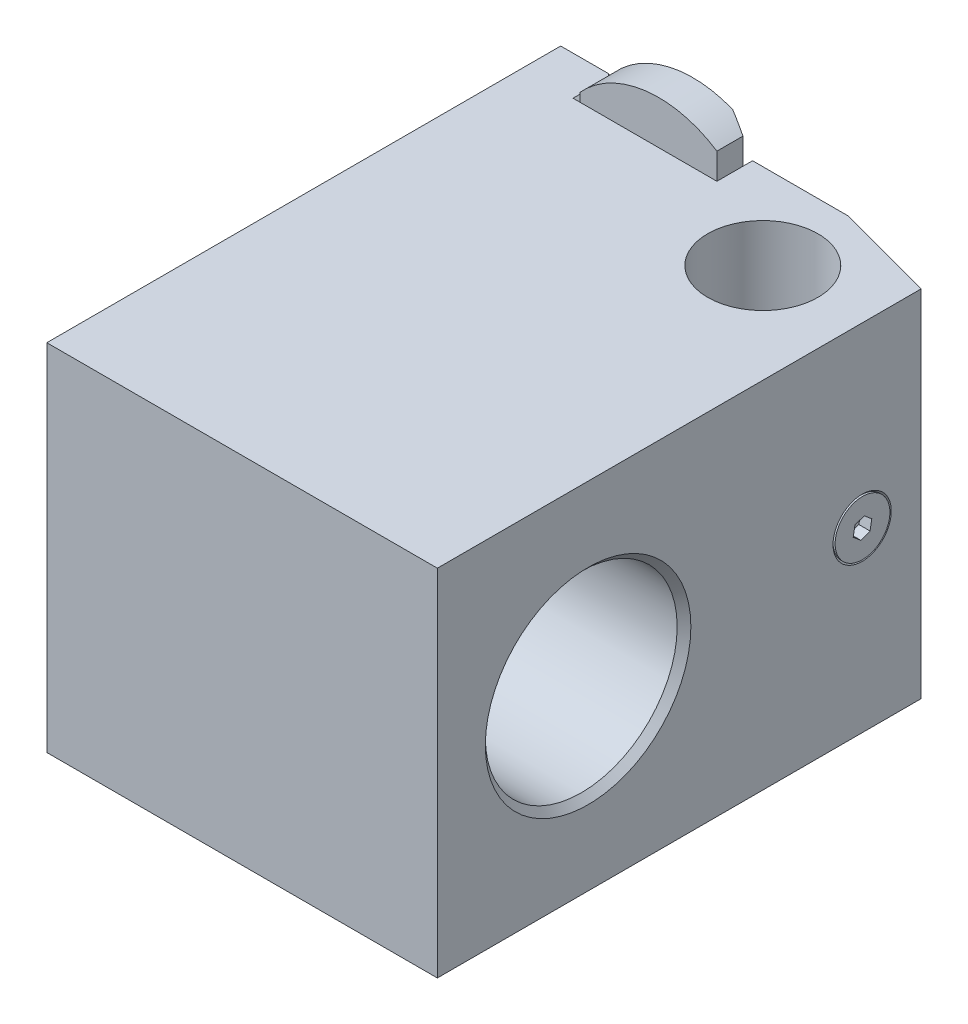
ISO-10303-21;
HEADER;
FILE_DESCRIPTION(('STEP AP214'),'2;1');
FILE_NAME('part.step','',(''),(''),'','','');
FILE_SCHEMA(('AUTOMOTIVE_DESIGN { 1 0 10303 214 1 1 1 1 }'));
ENDSEC;
DATA;
#1=APPLICATION_CONTEXT('core data for automotive mechanical design processes');
#2=APPLICATION_PROTOCOL_DEFINITION('international standard','automotive_design',2000,#1);
#3=PRODUCT_CONTEXT('',#1,'mechanical');
#4=PRODUCT('Part','Part','',(#3));
#5=PRODUCT_RELATED_PRODUCT_CATEGORY('part','',(#4));
#6=PRODUCT_DEFINITION_FORMATION('','',#4);
#7=PRODUCT_DEFINITION_CONTEXT('part definition',#1,'design');
#8=PRODUCT_DEFINITION('design','',#6,#7);
#9=PRODUCT_DEFINITION_SHAPE('','',#8);
#10=(LENGTH_UNIT() NAMED_UNIT(*) SI_UNIT(.MILLI.,.METRE.));
#11=(NAMED_UNIT(*) PLANE_ANGLE_UNIT() SI_UNIT($,.RADIAN.));
#12=(NAMED_UNIT(*) SI_UNIT($,.STERADIAN.) SOLID_ANGLE_UNIT());
#13=UNCERTAINTY_MEASURE_WITH_UNIT(LENGTH_MEASURE(1.E-05),#10,'distance_accuracy_value','');
#14=(GEOMETRIC_REPRESENTATION_CONTEXT(3) GLOBAL_UNCERTAINTY_ASSIGNED_CONTEXT((#13)) GLOBAL_UNIT_ASSIGNED_CONTEXT((#10,
#11,#12)) REPRESENTATION_CONTEXT('',''));
#15=CARTESIAN_POINT('',(0.,0.,0.));
#16=DIRECTION('',(0.,0.,1.));
#17=DIRECTION('',(1.,0.,0.));
#18=AXIS2_PLACEMENT_3D('',#15,#16,#17);
#19=CARTESIAN_POINT('',(39.,-25.9,-0.200000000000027));
#20=DIRECTION('',(0.,-1.,0.));
#21=DIRECTION('',(1.,0.,0.));
#22=AXIS2_PLACEMENT_3D('',#19,#20,#21);
#23=PLANE('',#22);
#24=CARTESIAN_POINT('',(24.5,-25.9,12.8));
#25=DIRECTION('',(0.,-1.,0.));
#26=DIRECTION('',(0.,0.,-1.));
#27=AXIS2_PLACEMENT_3D('',#24,#25,#26);
#28=CIRCLE('',#27,8.05);
#29=CARTESIAN_POINT('',(24.5,-25.9,4.75));
#30=VERTEX_POINT('',#29);
#31=EDGE_CURVE('E427',#30,#30,#28,.T.);
#32=ORIENTED_EDGE('',*,*,#31,.F.);
#33=EDGE_LOOP('',(#32));
#34=FACE_BOUND('',#33,.T.);
#35=DIRECTION('',(0.,0.,1.));
#36=VECTOR('',#35,1.);
#37=CARTESIAN_POINT('',(39.,-25.9,-0.200000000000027));
#38=LINE('',#37,#36);
#39=CARTESIAN_POINT('',(39.,-25.9,4.18526329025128));
#40=VERTEX_POINT('',#39);
#41=CARTESIAN_POINT('',(39.,-25.9,74.8));
#42=VERTEX_POINT('',#41);
#43=EDGE_CURVE('E881',#40,#42,#38,.T.);
#44=ORIENTED_EDGE('',*,*,#43,.T.);
#45=DIRECTION('',(1.,0.,0.));
#46=VECTOR('',#45,1.);
#47=CARTESIAN_POINT('',(39.,-25.9,74.8));
#48=LINE('',#47,#46);
#49=CARTESIAN_POINT('',(-18.,-25.9,74.8));
#50=VERTEX_POINT('',#49);
#51=EDGE_CURVE('E460',#50,#42,#48,.T.);
#52=ORIENTED_EDGE('',*,*,#51,.F.);
#53=DIRECTION('',(0.,0.,1.));
#54=VECTOR('',#53,1.);
#55=CARTESIAN_POINT('',(-18.,-25.9,17.0500000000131));
#56=LINE('',#55,#54);
#57=CARTESIAN_POINT('',(-18.,-25.9,-0.20000000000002));
#58=VERTEX_POINT('',#57);
#59=EDGE_CURVE('E467',#58,#50,#56,.T.);
#60=ORIENTED_EDGE('',*,*,#59,.F.);
#61=DIRECTION('',(1.,0.,0.));
#62=VECTOR('',#61,1.);
#63=CARTESIAN_POINT('',(-18.,-25.9,-0.20000000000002));
#64=LINE('',#63,#62);
#65=CARTESIAN_POINT('',(-11.,-25.9,-0.200000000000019));
#66=VERTEX_POINT('',#65);
#67=EDGE_CURVE('E469',#58,#66,#64,.T.);
#68=ORIENTED_EDGE('',*,*,#67,.T.);
#69=DIRECTION('',(0.707106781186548,0.,0.707106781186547));
#70=VECTOR('',#69,1.);
#71=CARTESIAN_POINT('',(14.,-25.9,24.8));
#72=LINE('',#71,#70);
#73=CARTESIAN_POINT('',(-10.5,-25.9,0.29999999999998));
#74=VERTEX_POINT('',#73);
#75=EDGE_CURVE('E883',#66,#74,#72,.T.);
#76=ORIENTED_EDGE('',*,*,#75,.T.);
#77=DIRECTION('',(0.,0.,1.));
#78=VECTOR('',#77,1.);
#79=CARTESIAN_POINT('',(-10.5,-25.9,-0.200000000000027));
#80=LINE('',#79,#78);
#81=CARTESIAN_POINT('',(-10.5,-25.9,5.5));
#82=VERTEX_POINT('',#81);
#83=EDGE_CURVE('E928',#74,#82,#80,.T.);
#84=ORIENTED_EDGE('',*,*,#83,.T.);
#85=DIRECTION('',(1.,0.,0.));
#86=VECTOR('',#85,1.);
#87=CARTESIAN_POINT('',(39.,-25.9,5.5));
#88=LINE('',#87,#86);
#89=CARTESIAN_POINT('',(10.5,-25.9,5.5));
#90=VERTEX_POINT('',#89);
#91=EDGE_CURVE('E933',#82,#90,#88,.T.);
#92=ORIENTED_EDGE('',*,*,#91,.T.);
#93=DIRECTION('',(0.,0.,1.));
#94=VECTOR('',#93,1.);
#95=CARTESIAN_POINT('',(10.5,-25.9,-0.200000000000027));
#96=LINE('',#95,#94);
#97=CARTESIAN_POINT('',(10.5,-25.9,0.29999999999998));
#98=VERTEX_POINT('',#97);
#99=EDGE_CURVE('E684',#90,#98,#96,.F.);
#100=ORIENTED_EDGE('',*,*,#99,.T.);
#101=DIRECTION('',(-1.,0.,0.));
#102=VECTOR('',#101,1.);
#103=CARTESIAN_POINT('',(39.,-25.9,0.29999999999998));
#104=LINE('',#103,#102);
#105=CARTESIAN_POINT('',(24.5,-25.9,0.29999999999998));
#106=VERTEX_POINT('',#105);
#107=EDGE_CURVE('E642',#106,#98,#104,.T.);
#108=ORIENTED_EDGE('',*,*,#107,.F.);
#109=DIRECTION('',(-0.965925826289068,0.,-0.258819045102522));
#110=VECTOR('',#109,1.);
#111=CARTESIAN_POINT('',(37.9036841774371,-25.9,3.8915063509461));
#112=LINE('',#111,#110);
#113=EDGE_CURVE('E1188',#40,#106,#112,.T.);
#114=ORIENTED_EDGE('',*,*,#113,.F.);
#115=EDGE_LOOP('',(#44,#52,#60,#68,#76,#84,#92,#100,#108,#114));
#116=FACE_BOUND('',#115,.T.);
#117=ADVANCED_FACE('F21',(#34,#116),#23,.T.);
#118=CARTESIAN_POINT('',(39.,25.9,-0.199999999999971));
#119=DIRECTION('',(0.,-1.,0.));
#120=DIRECTION('',(1.,0.,0.));
#121=AXIS2_PLACEMENT_3D('',#118,#119,#120);
#122=PLANE('',#121);
#123=CARTESIAN_POINT('',(24.5,25.9,12.8));
#124=DIRECTION('',(0.,1.,0.));
#125=DIRECTION('',(0.,0.,1.));
#126=AXIS2_PLACEMENT_3D('',#123,#124,#125);
#127=CIRCLE('',#126,8.05);
#128=CARTESIAN_POINT('',(24.5,25.9,20.85));
#129=VERTEX_POINT('',#128);
#130=EDGE_CURVE('E414',#129,#129,#127,.T.);
#131=ORIENTED_EDGE('',*,*,#130,.F.);
#132=EDGE_LOOP('',(#131));
#133=FACE_BOUND('',#132,.T.);
#134=DIRECTION('',(0.707106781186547,0.,0.707106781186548));
#135=VECTOR('',#134,1.);
#136=CARTESIAN_POINT('',(14.,25.9,24.8));
#137=LINE('',#136,#135);
#138=CARTESIAN_POINT('',(-11.,25.9,-0.19999999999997));
#139=VERTEX_POINT('',#138);
#140=CARTESIAN_POINT('',(-10.5,25.9,0.300000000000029));
#141=VERTEX_POINT('',#140);
#142=EDGE_CURVE('E634',#139,#141,#137,.T.);
#143=ORIENTED_EDGE('',*,*,#142,.F.);
#144=DIRECTION('',(1.,0.,0.));
#145=VECTOR('',#144,1.);
#146=CARTESIAN_POINT('',(-18.,25.9,-0.199999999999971));
#147=LINE('',#146,#145);
#148=CARTESIAN_POINT('',(-18.,25.9,-0.199999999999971));
#149=VERTEX_POINT('',#148);
#150=EDGE_CURVE('E472',#149,#139,#147,.T.);
#151=ORIENTED_EDGE('',*,*,#150,.F.);
#152=DIRECTION('',(0.,0.,-1.));
#153=VECTOR('',#152,1.);
#154=CARTESIAN_POINT('',(-18.,25.9,-0.199999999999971));
#155=LINE('',#154,#153);
#156=CARTESIAN_POINT('',(-18.,25.9,74.8));
#157=VERTEX_POINT('',#156);
#158=EDGE_CURVE('E463',#157,#149,#155,.T.);
#159=ORIENTED_EDGE('',*,*,#158,.F.);
#160=DIRECTION('',(-1.,0.,0.));
#161=VECTOR('',#160,1.);
#162=CARTESIAN_POINT('',(-18.,25.9,74.8));
#163=LINE('',#162,#161);
#164=CARTESIAN_POINT('',(39.,25.9,74.8));
#165=VERTEX_POINT('',#164);
#166=EDGE_CURVE('E454',#165,#157,#163,.T.);
#167=ORIENTED_EDGE('',*,*,#166,.F.);
#168=DIRECTION('',(0.,0.,1.));
#169=VECTOR('',#168,1.);
#170=CARTESIAN_POINT('',(39.,25.9,-0.199999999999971));
#171=LINE('',#170,#169);
#172=CARTESIAN_POINT('',(39.,25.9,4.18526329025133));
#173=VERTEX_POINT('',#172);
#174=EDGE_CURVE('E877',#173,#165,#171,.T.);
#175=ORIENTED_EDGE('',*,*,#174,.F.);
#176=DIRECTION('',(-0.965925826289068,0.,-0.258819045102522));
#177=VECTOR('',#176,1.);
#178=CARTESIAN_POINT('',(37.9036841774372,25.9,3.89150635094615));
#179=LINE('',#178,#177);
#180=CARTESIAN_POINT('',(24.5,25.9,0.300000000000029));
#181=VERTEX_POINT('',#180);
#182=EDGE_CURVE('E1193',#181,#173,#179,.F.);
#183=ORIENTED_EDGE('',*,*,#182,.F.);
#184=DIRECTION('',(-1.,0.,0.));
#185=VECTOR('',#184,1.);
#186=CARTESIAN_POINT('',(39.,25.9,0.300000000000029));
#187=LINE('',#186,#185);
#188=CARTESIAN_POINT('',(10.5,25.9,0.300000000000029));
#189=VERTEX_POINT('',#188);
#190=EDGE_CURVE('E1251',#189,#181,#187,.F.);
#191=ORIENTED_EDGE('',*,*,#190,.F.);
#192=DIRECTION('',(0.,0.,1.));
#193=VECTOR('',#192,1.);
#194=CARTESIAN_POINT('',(10.5,25.9,-0.199999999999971));
#195=LINE('',#194,#193);
#196=CARTESIAN_POINT('',(10.5,25.9,5.5));
#197=VERTEX_POINT('',#196);
#198=EDGE_CURVE('E1217',#189,#197,#195,.T.);
#199=ORIENTED_EDGE('',*,*,#198,.T.);
#200=DIRECTION('',(-1.,0.,0.));
#201=VECTOR('',#200,1.);
#202=CARTESIAN_POINT('',(39.,25.9,5.5));
#203=LINE('',#202,#201);
#204=CARTESIAN_POINT('',(-10.5,25.9,5.5));
#205=VERTEX_POINT('',#204);
#206=EDGE_CURVE('E604',#197,#205,#203,.T.);
#207=ORIENTED_EDGE('',*,*,#206,.T.);
#208=DIRECTION('',(0.,0.,1.));
#209=VECTOR('',#208,1.);
#210=CARTESIAN_POINT('',(-10.5,25.9,-0.199999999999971));
#211=LINE('',#210,#209);
#212=EDGE_CURVE('E475',#205,#141,#211,.F.);
#213=ORIENTED_EDGE('',*,*,#212,.T.);
#214=EDGE_LOOP('',(#143,#151,#159,#167,#175,#183,#191,#199,#207,#213));
#215=FACE_BOUND('',#214,.T.);
#216=ADVANCED_FACE('F1356',(#133,#215),#122,.F.);
#217=CARTESIAN_POINT('',(-18.,25.9,-0.199999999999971));
#218=DIRECTION('',(0.,0.,-1.));
#219=DIRECTION('',(1.,0.,0.));
#220=AXIS2_PLACEMENT_3D('',#217,#218,#219);
#221=PLANE('',#220);
#222=DIRECTION('',(0.707106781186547,0.707106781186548,0.));
#223=VECTOR('',#222,1.);
#224=CARTESIAN_POINT('',(-10.25,-25.15,-0.20000000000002));
#225=LINE('',#224,#223);
#226=CARTESIAN_POINT('',(-10.5,-25.4,-0.200000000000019));
#227=VERTEX_POINT('',#226);
#228=EDGE_CURVE('E1042',#66,#227,#225,.T.);
#229=ORIENTED_EDGE('',*,*,#228,.F.);
#230=ORIENTED_EDGE('',*,*,#67,.F.);
#231=DIRECTION('',(0.,-1.,0.));
#232=VECTOR('',#231,1.);
#233=CARTESIAN_POINT('',(-18.,-25.9,-0.20000000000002));
#234=LINE('',#233,#232);
#235=EDGE_CURVE('E465',#149,#58,#234,.T.);
#236=ORIENTED_EDGE('',*,*,#235,.F.);
#237=ORIENTED_EDGE('',*,*,#150,.T.);
#238=DIRECTION('',(0.707106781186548,-0.707106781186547,0.));
#239=VECTOR('',#238,1.);
#240=CARTESIAN_POINT('',(-14.5,29.4,-0.199999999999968));
#241=LINE('',#240,#239);
#242=CARTESIAN_POINT('',(-10.5,25.4,-0.199999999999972));
#243=VERTEX_POINT('',#242);
#244=EDGE_CURVE('E639',#139,#243,#241,.T.);
#245=ORIENTED_EDGE('',*,*,#244,.T.);
#246=DIRECTION('',(0.,-1.,0.));
#247=VECTOR('',#246,1.);
#248=CARTESIAN_POINT('',(-10.5,25.9,-0.199999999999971));
#249=LINE('',#248,#247);
#250=EDGE_CURVE('E706',#243,#227,#249,.T.);
#251=ORIENTED_EDGE('',*,*,#250,.T.);
#252=EDGE_LOOP('',(#229,#230,#236,#237,#245,#251));
#253=FACE_BOUND('',#252,.T.);
#254=ADVANCED_FACE('F1370',(#253),#221,.T.);
#255=CARTESIAN_POINT('',(39.,25.9,74.8));
#256=DIRECTION('',(1.,0.,0.));
#257=DIRECTION('',(0.,0.,1.));
#258=AXIS2_PLACEMENT_3D('',#255,#256,#257);
#259=PLANE('',#258);
#260=CARTESIAN_POINT('',(39.,0.,52.8));
#261=DIRECTION('',(1.,0.,0.));
#262=DIRECTION('',(0.,0.,-1.));
#263=AXIS2_PLACEMENT_3D('',#260,#261,#262);
#264=CIRCLE('',#263,15.);
#265=CARTESIAN_POINT('',(39.,0.,37.8));
#266=VERTEX_POINT('',#265);
#267=EDGE_CURVE('E30',#266,#266,#264,.F.);
#268=ORIENTED_EDGE('',*,*,#267,.T.);
#269=EDGE_LOOP('',(#268));
#270=FACE_BOUND('',#269,.T.);
#271=CARTESIAN_POINT('',(38.9999999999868,0.,12.8));
#272=DIRECTION('',(1.,0.,0.));
#273=DIRECTION('',(0.,0.,1.));
#274=AXIS2_PLACEMENT_3D('',#271,#272,#273);
#275=CIRCLE('',#274,4.25000000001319);
#276=CARTESIAN_POINT('',(38.9999999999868,0.,17.0500000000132));
#277=VERTEX_POINT('',#276);
#278=EDGE_CURVE('E711',#277,#277,#275,.F.);
#279=ORIENTED_EDGE('',*,*,#278,.T.);
#280=EDGE_LOOP('',(#279));
#281=FACE_BOUND('',#280,.T.);
#282=ORIENTED_EDGE('',*,*,#174,.T.);
#283=DIRECTION('',(0.,1.,0.));
#284=VECTOR('',#283,1.);
#285=CARTESIAN_POINT('',(39.,25.9,74.8));
#286=LINE('',#285,#284);
#287=EDGE_CURVE('E448',#42,#165,#286,.T.);
#288=ORIENTED_EDGE('',*,*,#287,.F.);
#289=ORIENTED_EDGE('',*,*,#43,.F.);
#290=DIRECTION('',(0.,1.,0.));
#291=VECTOR('',#290,1.);
#292=CARTESIAN_POINT('',(39.,25.9,4.18526329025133));
#293=LINE('',#292,#291);
#294=EDGE_CURVE('E640',#40,#173,#293,.T.);
#295=ORIENTED_EDGE('',*,*,#294,.T.);
#296=EDGE_LOOP('',(#282,#288,#289,#295));
#297=FACE_BOUND('',#296,.T.);
#298=ADVANCED_FACE('F1385',(#270,#281,#297),#259,.T.);
#299=CARTESIAN_POINT('',(0.,-9.,1.));
#300=DIRECTION('',(0.,0.,-1.));
#301=DIRECTION('',(0.,-1.,0.));
#302=AXIS2_PLACEMENT_3D('',#299,#300,#301);
#303=CYLINDRICAL_SURFACE('',#302,5.25);
#304=CARTESIAN_POINT('',(0.,-9.,0.));
#305=DIRECTION('',(0.,0.,-1.));
#306=DIRECTION('',(0.,-1.,0.));
#307=AXIS2_PLACEMENT_3D('',#304,#305,#306);
#308=CIRCLE('',#307,5.25);
#309=CARTESIAN_POINT('',(0.,-14.25,0.));
#310=VERTEX_POINT('',#309);
#311=EDGE_CURVE('E584',#310,#310,#308,.T.);
#312=ORIENTED_EDGE('',*,*,#311,.T.);
#313=EDGE_LOOP('',(#312));
#314=FACE_BOUND('',#313,.T.);
#315=CARTESIAN_POINT('',(0.,-9.,1.00000000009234));
#316=DIRECTION('',(0.,0.,1.));
#317=DIRECTION('',(1.,0.,0.));
#318=AXIS2_PLACEMENT_3D('',#315,#316,#317);
#319=CIRCLE('',#318,5.24999999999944);
#320=CARTESIAN_POINT('',(5.24999999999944,-9.,1.00000000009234));
#321=VERTEX_POINT('',#320);
#322=EDGE_CURVE('E1719',#321,#321,#319,.T.);
#323=ORIENTED_EDGE('',*,*,#322,.T.);
#324=EDGE_LOOP('',(#323));
#325=FACE_BOUND('',#324,.T.);
#326=ADVANCED_FACE('F1645',(#314,#325),#303,.F.);
#327=CARTESIAN_POINT('',(0.,9.,1.));
#328=DIRECTION('',(0.,0.,-1.));
#329=DIRECTION('',(0.,-1.,0.));
#330=AXIS2_PLACEMENT_3D('',#327,#328,#329);
#331=CYLINDRICAL_SURFACE('',#330,5.25);
#332=CARTESIAN_POINT('',(0.,9.,0.));
#333=DIRECTION('',(0.,0.,-1.));
#334=DIRECTION('',(0.,-1.,0.));
#335=AXIS2_PLACEMENT_3D('',#332,#333,#334);
#336=CIRCLE('',#335,5.25);
#337=CARTESIAN_POINT('',(0.,3.75,0.));
#338=VERTEX_POINT('',#337);
#339=EDGE_CURVE('E1059',#338,#338,#336,.T.);
#340=ORIENTED_EDGE('',*,*,#339,.T.);
#341=EDGE_LOOP('',(#340));
#342=FACE_BOUND('',#341,.T.);
#343=CARTESIAN_POINT('',(0.,9.,1.00000000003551));
#344=DIRECTION('',(0.,0.,1.));
#345=DIRECTION('',(1.,0.,0.));
#346=AXIS2_PLACEMENT_3D('',#343,#344,#345);
#347=CIRCLE('',#346,5.25000000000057);
#348=CARTESIAN_POINT('',(5.25000000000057,9.,1.00000000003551));
#349=VERTEX_POINT('',#348);
#350=EDGE_CURVE('E1724',#349,#349,#347,.T.);
#351=ORIENTED_EDGE('',*,*,#350,.T.);
#352=EDGE_LOOP('',(#351));
#353=FACE_BOUND('',#352,.T.);
#354=ADVANCED_FACE('F1806',(#342,#353),#331,.F.);
#355=CARTESIAN_POINT('',(7.3,-31.75,0.));
#356=DIRECTION('',(0.,0.,1.));
#357=DIRECTION('',(-1.,0.,0.));
#358=AXIS2_PLACEMENT_3D('',#355,#356,#357);
#359=PLANE('',#358);
#360=CARTESIAN_POINT('',(1.5,-16.25,0.));
#361=DIRECTION('',(0.,0.,-1.));
#362=DIRECTION('',(0.,-1.,0.));
#363=AXIS2_PLACEMENT_3D('',#360,#361,#362);
#364=CIRCLE('',#363,15.5);
#365=CARTESIAN_POINT('',(-10.,-26.6423048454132,0.));
#366=VERTEX_POINT('',#365);
#367=CARTESIAN_POINT('',(7.3,-30.6239347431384,0.));
#368=VERTEX_POINT('',#367);
#369=EDGE_CURVE('E742',#366,#368,#364,.F.);
#370=ORIENTED_EDGE('',*,*,#369,.F.);
#371=DIRECTION('',(0.,-1.,0.));
#372=VECTOR('',#371,1.);
#373=CARTESIAN_POINT('',(-10.,-31.75,0.));
#374=LINE('',#373,#372);
#375=CARTESIAN_POINT('',(-10.,26.6423048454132,0.));
#376=VERTEX_POINT('',#375);
#377=EDGE_CURVE('E1194',#366,#376,#374,.F.);
#378=ORIENTED_EDGE('',*,*,#377,.T.);
#379=CARTESIAN_POINT('',(1.5,16.25,0.));
#380=DIRECTION('',(0.,0.,-1.));
#381=DIRECTION('',(0.,-1.,0.));
#382=AXIS2_PLACEMENT_3D('',#379,#380,#381);
#383=CIRCLE('',#382,15.5);
#384=CARTESIAN_POINT('',(7.3,30.6239347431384,0.));
#385=VERTEX_POINT('',#384);
#386=EDGE_CURVE('E533',#385,#376,#383,.F.);
#387=ORIENTED_EDGE('',*,*,#386,.F.);
#388=DIRECTION('',(0.,-1.,0.));
#389=VECTOR('',#388,1.);
#390=CARTESIAN_POINT('',(7.3,-31.75,0.));
#391=LINE('',#390,#389);
#392=EDGE_CURVE('E510',#385,#368,#391,.T.);
#393=ORIENTED_EDGE('',*,*,#392,.T.);
#394=EDGE_LOOP('',(#370,#378,#387,#393));
#395=FACE_BOUND('',#394,.T.);
#396=ORIENTED_EDGE('',*,*,#311,.F.);
#397=EDGE_LOOP('',(#396));
#398=FACE_BOUND('',#397,.T.);
#399=ORIENTED_EDGE('',*,*,#339,.F.);
#400=EDGE_LOOP('',(#399));
#401=FACE_BOUND('',#400,.T.);
#402=ADVANCED_FACE('F1261',(#395,#398,#401),#359,.F.);
#403=CARTESIAN_POINT('',(-10.5,25.9,-0.199999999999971));
#404=DIRECTION('',(0.707106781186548,0.,-0.707106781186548));
#405=DIRECTION('',(0.707106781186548,0.,0.707106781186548));
#406=AXIS2_PLACEMENT_3D('',#403,#404,#405);
#407=PLANE('',#406);
#408=DIRECTION('',(0.707106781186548,0.,0.707106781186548));
#409=VECTOR('',#408,1.);
#410=CARTESIAN_POINT('',(-10.5,-25.4,-0.200000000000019));
#411=LINE('',#410,#409);
#412=CARTESIAN_POINT('',(-10.,-25.4,0.299999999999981));
#413=VERTEX_POINT('',#412);
#414=EDGE_CURVE('E710',#227,#413,#411,.T.);
#415=ORIENTED_EDGE('',*,*,#414,.F.);
#416=ORIENTED_EDGE('',*,*,#250,.F.);
#417=DIRECTION('',(0.707106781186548,0.,0.707106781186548));
#418=VECTOR('',#417,1.);
#419=CARTESIAN_POINT('',(-10.5,25.4,-0.199999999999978));
#420=LINE('',#419,#418);
#421=CARTESIAN_POINT('',(-10.,25.4,0.300000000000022));
#422=VERTEX_POINT('',#421);
#423=EDGE_CURVE('E610',#243,#422,#420,.T.);
#424=ORIENTED_EDGE('',*,*,#423,.T.);
#425=DIRECTION('',(0.,1.,0.));
#426=VECTOR('',#425,1.);
#427=CARTESIAN_POINT('',(-10.,-31.75,0.299999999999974));
#428=LINE('',#427,#426);
#429=EDGE_CURVE('E682',#413,#422,#428,.T.);
#430=ORIENTED_EDGE('',*,*,#429,.F.);
#431=EDGE_LOOP('',(#415,#416,#424,#430));
#432=FACE_BOUND('',#431,.T.);
#433=ADVANCED_FACE('F1661',(#432),#407,.T.);
#434=CARTESIAN_POINT('',(1.5,-16.25,5.));
#435=DIRECTION('',(0.,0.,-1.));
#436=DIRECTION('',(0.,-1.,0.));
#437=AXIS2_PLACEMENT_3D('',#434,#435,#436);
#438=CYLINDRICAL_SURFACE('',#437,15.5);
#439=DIRECTION('',(0.,0.,-1.));
#440=VECTOR('',#439,1.);
#441=CARTESIAN_POINT('',(-10.,-26.6423048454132,0.));
#442=LINE('',#441,#440);
#443=CARTESIAN_POINT('',(-10.,-26.6423048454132,5.));
#444=VERTEX_POINT('',#443);
#445=EDGE_CURVE('E585',#444,#366,#442,.T.);
#446=ORIENTED_EDGE('',*,*,#445,.T.);
#447=ORIENTED_EDGE('',*,*,#369,.T.);
#448=CARTESIAN_POINT('',(1.5,-16.25,-2.57777777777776));
#449=DIRECTION('',(-0.406138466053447,0.,0.913811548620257));
#450=DIRECTION('',(-0.913811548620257,0.,-0.406138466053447));
#451=AXIS2_PLACEMENT_3D('',#448,#449,#450);
#452=ELLIPSE('',#451,16.9619217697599,15.5);
#453=CARTESIAN_POINT('',(10.,-29.2114813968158,1.19999999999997));
#454=VERTEX_POINT('',#453);
#455=EDGE_CURVE('E737',#368,#454,#452,.T.);
#456=ORIENTED_EDGE('',*,*,#455,.T.);
#457=DIRECTION('',(0.,0.,-1.));
#458=VECTOR('',#457,1.);
#459=CARTESIAN_POINT('',(10.,-29.2114813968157,5.));
#460=LINE('',#459,#458);
#461=CARTESIAN_POINT('',(10.,-29.2114813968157,5.));
#462=VERTEX_POINT('',#461);
#463=EDGE_CURVE('E777',#454,#462,#460,.F.);
#464=ORIENTED_EDGE('',*,*,#463,.T.);
#465=CARTESIAN_POINT('',(1.5,-16.25,5.));
#466=DIRECTION('',(0.,0.,-1.));
#467=DIRECTION('',(0.,-1.,0.));
#468=AXIS2_PLACEMENT_3D('',#465,#466,#467);
#469=CIRCLE('',#468,15.5);
#470=EDGE_CURVE('E760',#462,#444,#469,.T.);
#471=ORIENTED_EDGE('',*,*,#470,.T.);
#472=EDGE_LOOP('',(#446,#447,#456,#464,#471));
#473=FACE_BOUND('',#472,.T.);
#474=ADVANCED_FACE('F1664',(#473),#438,.T.);
#475=CARTESIAN_POINT('',(1.5,16.25,5.));
#476=DIRECTION('',(0.,0.,-1.));
#477=DIRECTION('',(0.,-1.,0.));
#478=AXIS2_PLACEMENT_3D('',#475,#476,#477);
#479=CYLINDRICAL_SURFACE('',#478,15.5);
#480=ORIENTED_EDGE('',*,*,#386,.T.);
#481=DIRECTION('',(0.,0.,-1.));
#482=VECTOR('',#481,1.);
#483=CARTESIAN_POINT('',(-10.,26.6423048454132,5.));
#484=LINE('',#483,#482);
#485=CARTESIAN_POINT('',(-10.,26.6423048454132,5.));
#486=VERTEX_POINT('',#485);
#487=EDGE_CURVE('E1270',#376,#486,#484,.F.);
#488=ORIENTED_EDGE('',*,*,#487,.T.);
#489=CARTESIAN_POINT('',(1.5,16.25,5.));
#490=DIRECTION('',(0.,0.,-1.));
#491=DIRECTION('',(0.,-1.,0.));
#492=AXIS2_PLACEMENT_3D('',#489,#490,#491);
#493=CIRCLE('',#492,15.5);
#494=CARTESIAN_POINT('',(10.,29.2114813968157,5.00000000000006));
#495=VERTEX_POINT('',#494);
#496=EDGE_CURVE('E513',#486,#495,#493,.T.);
#497=ORIENTED_EDGE('',*,*,#496,.T.);
#498=DIRECTION('',(0.,0.,-1.));
#499=VECTOR('',#498,1.);
#500=CARTESIAN_POINT('',(10.,29.2114813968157,5.));
#501=LINE('',#500,#499);
#502=CARTESIAN_POINT('',(10.,29.2114813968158,1.20000000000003));
#503=VERTEX_POINT('',#502);
#504=EDGE_CURVE('E772',#495,#503,#501,.T.);
#505=ORIENTED_EDGE('',*,*,#504,.T.);
#506=CARTESIAN_POINT('',(1.5,16.25,-2.57777777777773));
#507=DIRECTION('',(-0.406138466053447,0.,0.913811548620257));
#508=DIRECTION('',(-0.913811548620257,0.,-0.406138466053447));
#509=AXIS2_PLACEMENT_3D('',#506,#507,#508);
#510=ELLIPSE('',#509,16.9619217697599,15.5);
#511=EDGE_CURVE('E790',#503,#385,#510,.T.);
#512=ORIENTED_EDGE('',*,*,#511,.T.);
#513=EDGE_LOOP('',(#480,#488,#497,#505,#512));
#514=FACE_BOUND('',#513,.T.);
#515=ADVANCED_FACE('F1276',(#514),#479,.T.);
#516=CARTESIAN_POINT('',(10.,-31.75,1.19999999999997));
#517=DIRECTION('',(-0.406138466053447,0.,0.913811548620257));
#518=DIRECTION('',(-0.913811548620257,0.,-0.406138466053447));
#519=AXIS2_PLACEMENT_3D('',#516,#517,#518);
#520=PLANE('',#519);
#521=ORIENTED_EDGE('',*,*,#511,.F.);
#522=DIRECTION('',(0.,1.,0.));
#523=VECTOR('',#522,1.);
#524=CARTESIAN_POINT('',(10.,-31.75,1.19999999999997));
#525=LINE('',#524,#523);
#526=CARTESIAN_POINT('',(10.,25.4,1.20000000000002));
#527=VERTEX_POINT('',#526);
#528=EDGE_CURVE('E531',#503,#527,#525,.F.);
#529=ORIENTED_EDGE('',*,*,#528,.T.);
#530=CARTESIAN_POINT('',(10.,-25.4,1.19999999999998));
#531=VERTEX_POINT('',#530);
#532=EDGE_CURVE('E2294',#527,#531,#525,.F.);
#533=ORIENTED_EDGE('',*,*,#532,.T.);
#534=EDGE_CURVE('E1275',#531,#454,#525,.F.);
#535=ORIENTED_EDGE('',*,*,#534,.T.);
#536=ORIENTED_EDGE('',*,*,#455,.F.);
#537=ORIENTED_EDGE('',*,*,#392,.F.);
#538=EDGE_LOOP('',(#521,#529,#533,#535,#536,#537));
#539=FACE_BOUND('',#538,.T.);
#540=ADVANCED_FACE('F1785',(#539),#520,.F.);
#541=CARTESIAN_POINT('',(10.,-31.75,1.19999999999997));
#542=DIRECTION('',(-1.,0.,0.));
#543=DIRECTION('',(0.,1.,0.));
#544=AXIS2_PLACEMENT_3D('',#541,#542,#543);
#545=PLANE('',#544);
#546=ORIENTED_EDGE('',*,*,#534,.F.);
#547=DIRECTION('',(0.,0.,1.));
#548=VECTOR('',#547,1.);
#549=CARTESIAN_POINT('',(10.,-25.4,1.19999999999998));
#550=LINE('',#549,#548);
#551=CARTESIAN_POINT('',(10.,-25.4,5.));
#552=VERTEX_POINT('',#551);
#553=EDGE_CURVE('E981',#531,#552,#550,.T.);
#554=ORIENTED_EDGE('',*,*,#553,.T.);
#555=DIRECTION('',(0.,-1.,0.));
#556=VECTOR('',#555,1.);
#557=CARTESIAN_POINT('',(10.,-31.75,5.));
#558=LINE('',#557,#556);
#559=EDGE_CURVE('E1071',#552,#462,#558,.T.);
#560=ORIENTED_EDGE('',*,*,#559,.T.);
#561=ORIENTED_EDGE('',*,*,#463,.F.);
#562=EDGE_LOOP('',(#546,#554,#560,#561));
#563=FACE_BOUND('',#562,.T.);
#564=ADVANCED_FACE('F1780',(#563),#545,.F.);
#565=CARTESIAN_POINT('',(10.,-31.75,5.));
#566=DIRECTION('',(0.,0.,-1.));
#567=DIRECTION('',(0.,-1.,0.));
#568=AXIS2_PLACEMENT_3D('',#565,#566,#567);
#569=PLANE('',#568);
#570=ORIENTED_EDGE('',*,*,#559,.F.);
#571=DIRECTION('',(-1.,0.,0.));
#572=VECTOR('',#571,1.);
#573=CARTESIAN_POINT('',(10.,-25.4,5.));
#574=LINE('',#573,#572);
#575=CARTESIAN_POINT('',(-10.,-25.4,5.));
#576=VERTEX_POINT('',#575);
#577=EDGE_CURVE('E1053',#552,#576,#574,.T.);
#578=ORIENTED_EDGE('',*,*,#577,.T.);
#579=DIRECTION('',(0.,-1.,0.));
#580=VECTOR('',#579,1.);
#581=CARTESIAN_POINT('',(-10.,-31.75,5.));
#582=LINE('',#581,#580);
#583=EDGE_CURVE('E1072',#444,#576,#582,.F.);
#584=ORIENTED_EDGE('',*,*,#583,.F.);
#585=ORIENTED_EDGE('',*,*,#470,.F.);
#586=EDGE_LOOP('',(#570,#578,#584,#585));
#587=FACE_BOUND('',#586,.T.);
#588=ADVANCED_FACE('F1639',(#587),#569,.F.);
#589=CARTESIAN_POINT('',(-10.,-25.4,0.299999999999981));
#590=DIRECTION('',(0.577350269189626,-0.577350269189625,-0.577350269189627));
#591=DIRECTION('',(0.707106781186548,0.707106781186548,0.));
#592=AXIS2_PLACEMENT_3D('',#589,#590,#591);
#593=PLANE('',#592);
#594=DIRECTION('',(0.707106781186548,0.707106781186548,0.));
#595=VECTOR('',#594,1.);
#596=CARTESIAN_POINT('',(-10.,-25.4,0.299999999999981));
#597=LINE('',#596,#595);
#598=EDGE_CURVE('E959',#74,#413,#597,.T.);
#599=ORIENTED_EDGE('',*,*,#598,.F.);
#600=ORIENTED_EDGE('',*,*,#75,.F.);
#601=ORIENTED_EDGE('',*,*,#228,.T.);
#602=ORIENTED_EDGE('',*,*,#414,.T.);
#603=EDGE_LOOP('',(#599,#600,#601,#602));
#604=FACE_BOUND('',#603,.T.);
#605=ADVANCED_FACE('F1636',(#604),#593,.T.);
#606=CARTESIAN_POINT('',(-10.5,25.9,0.300000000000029));
#607=DIRECTION('',(0.577350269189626,0.577350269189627,-0.577350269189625));
#608=DIRECTION('',(-0.707106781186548,0.707106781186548,0.));
#609=AXIS2_PLACEMENT_3D('',#606,#607,#608);
#610=PLANE('',#609);
#611=ORIENTED_EDGE('',*,*,#423,.F.);
#612=ORIENTED_EDGE('',*,*,#244,.F.);
#613=ORIENTED_EDGE('',*,*,#142,.T.);
#614=DIRECTION('',(0.707106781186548,-0.707106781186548,0.));
#615=VECTOR('',#614,1.);
#616=CARTESIAN_POINT('',(-10.5,25.9,0.300000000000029));
#617=LINE('',#616,#615);
#618=EDGE_CURVE('E659',#141,#422,#617,.T.);
#619=ORIENTED_EDGE('',*,*,#618,.T.);
#620=EDGE_LOOP('',(#611,#612,#613,#619));
#621=FACE_BOUND('',#620,.T.);
#622=ADVANCED_FACE('F1364',(#621),#610,.T.);
#623=CARTESIAN_POINT('',(-10.,-31.75,0.));
#624=DIRECTION('',(1.,0.,0.));
#625=DIRECTION('',(0.,-1.,0.));
#626=AXIS2_PLACEMENT_3D('',#623,#624,#625);
#627=PLANE('',#626);
#628=DIRECTION('',(0.,0.,-1.));
#629=VECTOR('',#628,1.);
#630=CARTESIAN_POINT('',(-10.,25.4,0.));
#631=LINE('',#630,#629);
#632=CARTESIAN_POINT('',(-10.,25.4,5.));
#633=VERTEX_POINT('',#632);
#634=EDGE_CURVE('E550',#633,#422,#631,.T.);
#635=ORIENTED_EDGE('',*,*,#634,.F.);
#636=EDGE_CURVE('E763',#633,#486,#582,.F.);
#637=ORIENTED_EDGE('',*,*,#636,.T.);
#638=ORIENTED_EDGE('',*,*,#487,.F.);
#639=ORIENTED_EDGE('',*,*,#377,.F.);
#640=ORIENTED_EDGE('',*,*,#445,.F.);
#641=ORIENTED_EDGE('',*,*,#583,.T.);
#642=DIRECTION('',(0.,0.,-1.));
#643=VECTOR('',#642,1.);
#644=CARTESIAN_POINT('',(-10.,-25.4,0.));
#645=LINE('',#644,#643);
#646=EDGE_CURVE('E980',#576,#413,#645,.T.);
#647=ORIENTED_EDGE('',*,*,#646,.T.);
#648=ORIENTED_EDGE('',*,*,#429,.T.);
#649=EDGE_LOOP('',(#635,#637,#638,#639,#640,#641,#647,#648));
#650=FACE_BOUND('',#649,.T.);
#651=ADVANCED_FACE('F1266',(#650),#627,.F.);
#652=DIRECTION('',(-1.,0.,0.));
#653=VECTOR('',#652,1.);
#654=CARTESIAN_POINT('',(10.,25.4,5.));
#655=LINE('',#654,#653);
#656=CARTESIAN_POINT('',(10.,25.4,5.));
#657=VERTEX_POINT('',#656);
#658=EDGE_CURVE('E1057',#657,#633,#655,.T.);
#659=ORIENTED_EDGE('',*,*,#658,.F.);
#660=EDGE_CURVE('E1058',#495,#657,#558,.T.);
#661=ORIENTED_EDGE('',*,*,#660,.F.);
#662=ORIENTED_EDGE('',*,*,#496,.F.);
#663=ORIENTED_EDGE('',*,*,#636,.F.);
#664=EDGE_LOOP('',(#659,#661,#662,#663));
#665=FACE_BOUND('',#664,.T.);
#666=ADVANCED_FACE('F1782',(#665),#569,.F.);
#667=DIRECTION('',(0.,0.,1.));
#668=VECTOR('',#667,1.);
#669=CARTESIAN_POINT('',(10.,25.4,1.20000000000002));
#670=LINE('',#669,#668);
#671=EDGE_CURVE('E977',#527,#657,#670,.T.);
#672=ORIENTED_EDGE('',*,*,#671,.F.);
#673=ORIENTED_EDGE('',*,*,#528,.F.);
#674=ORIENTED_EDGE('',*,*,#504,.F.);
#675=ORIENTED_EDGE('',*,*,#660,.T.);
#676=EDGE_LOOP('',(#672,#673,#674,#675));
#677=FACE_BOUND('',#676,.T.);
#678=ADVANCED_FACE('F1625',(#677),#545,.F.);
#679=CARTESIAN_POINT('',(10.,25.9,0.300000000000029));
#680=DIRECTION('',(1.,0.,0.));
#681=DIRECTION('',(0.,1.,0.));
#682=AXIS2_PLACEMENT_3D('',#679,#680,#681);
#683=PLANE('',#682);
#684=DIRECTION('',(0.,0.,1.));
#685=VECTOR('',#684,1.);
#686=CARTESIAN_POINT('',(10.,-25.4,0.299999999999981));
#687=LINE('',#686,#685);
#688=CARTESIAN_POINT('',(10.,-25.4,0.29999999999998));
#689=VERTEX_POINT('',#688);
#690=EDGE_CURVE('E935',#531,#689,#687,.F.);
#691=ORIENTED_EDGE('',*,*,#690,.F.);
#692=ORIENTED_EDGE('',*,*,#532,.F.);
#693=DIRECTION('',(0.,0.,1.));
#694=VECTOR('',#693,1.);
#695=CARTESIAN_POINT('',(10.,25.4,0.300000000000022));
#696=LINE('',#695,#694);
#697=CARTESIAN_POINT('',(10.,25.4,0.300000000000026));
#698=VERTEX_POINT('',#697);
#699=EDGE_CURVE('E996',#698,#527,#696,.T.);
#700=ORIENTED_EDGE('',*,*,#699,.F.);
#701=DIRECTION('',(0.,1.,0.));
#702=VECTOR('',#701,1.);
#703=CARTESIAN_POINT('',(10.,25.9,0.300000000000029));
#704=LINE('',#703,#702);
#705=EDGE_CURVE('E1244',#698,#689,#704,.F.);
#706=ORIENTED_EDGE('',*,*,#705,.T.);
#707=EDGE_LOOP('',(#691,#692,#700,#706));
#708=FACE_BOUND('',#707,.T.);
#709=ADVANCED_FACE('F1622',(#708),#683,.F.);
#710=CARTESIAN_POINT('',(10.,25.9,0.300000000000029));
#711=DIRECTION('',(0.,0.,1.));
#712=DIRECTION('',(-1.,0.,0.));
#713=AXIS2_PLACEMENT_3D('',#710,#711,#712);
#714=PLANE('',#713);
#715=DIRECTION('',(0.,-1.,0.));
#716=VECTOR('',#715,1.);
#717=CARTESIAN_POINT('',(24.5,25.9,0.300000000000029));
#718=LINE('',#717,#716);
#719=EDGE_CURVE('E714',#106,#181,#718,.F.);
#720=ORIENTED_EDGE('',*,*,#719,.F.);
#721=ORIENTED_EDGE('',*,*,#107,.T.);
#722=DIRECTION('',(-0.707106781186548,0.707106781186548,0.));
#723=VECTOR('',#722,1.);
#724=CARTESIAN_POINT('',(10.,-25.4,0.29999999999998));
#725=LINE('',#724,#723);
#726=EDGE_CURVE('E1239',#98,#689,#725,.T.);
#727=ORIENTED_EDGE('',*,*,#726,.T.);
#728=ORIENTED_EDGE('',*,*,#705,.F.);
#729=DIRECTION('',(-0.707106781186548,-0.707106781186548,0.));
#730=VECTOR('',#729,1.);
#731=CARTESIAN_POINT('',(10.5,25.9,0.300000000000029));
#732=LINE('',#731,#730);
#733=EDGE_CURVE('E1243',#698,#189,#732,.F.);
#734=ORIENTED_EDGE('',*,*,#733,.T.);
#735=ORIENTED_EDGE('',*,*,#190,.T.);
#736=EDGE_LOOP('',(#720,#721,#727,#728,#734,#735));
#737=FACE_BOUND('',#736,.T.);
#738=ADVANCED_FACE('F1613',(#737),#714,.F.);
#739=CARTESIAN_POINT('',(10.,-25.4,0.299999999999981));
#740=DIRECTION('',(-0.707106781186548,-0.707106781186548,0.));
#741=DIRECTION('',(0.707106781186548,-0.707106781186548,0.));
#742=AXIS2_PLACEMENT_3D('',#739,#740,#741);
#743=PLANE('',#742);
#744=DIRECTION('',(-0.577350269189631,0.577350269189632,-0.577350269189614));
#745=VECTOR('',#744,1.);
#746=CARTESIAN_POINT('',(10.5,-25.9,5.5));
#747=LINE('',#746,#745);
#748=EDGE_CURVE('E958',#90,#552,#747,.T.);
#749=ORIENTED_EDGE('',*,*,#748,.T.);
#750=ORIENTED_EDGE('',*,*,#553,.F.);
#751=ORIENTED_EDGE('',*,*,#690,.T.);
#752=ORIENTED_EDGE('',*,*,#726,.F.);
#753=ORIENTED_EDGE('',*,*,#99,.F.);
#754=EDGE_LOOP('',(#749,#750,#751,#752,#753));
#755=FACE_BOUND('',#754,.T.);
#756=ADVANCED_FACE('F1517',(#755),#743,.T.);
#757=CARTESIAN_POINT('',(-10.,-25.4,5.));
#758=DIRECTION('',(0.,-0.707106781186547,-0.707106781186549));
#759=DIRECTION('',(0.,-0.707106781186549,0.707106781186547));
#760=AXIS2_PLACEMENT_3D('',#757,#758,#759);
#761=PLANE('',#760);
#762=DIRECTION('',(0.577350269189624,0.577350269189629,-0.577350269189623));
#763=VECTOR('',#762,1.);
#764=CARTESIAN_POINT('',(-10.5,-25.9,5.5));
#765=LINE('',#764,#763);
#766=EDGE_CURVE('E953',#82,#576,#765,.T.);
#767=ORIENTED_EDGE('',*,*,#766,.T.);
#768=ORIENTED_EDGE('',*,*,#577,.F.);
#769=ORIENTED_EDGE('',*,*,#748,.F.);
#770=ORIENTED_EDGE('',*,*,#91,.F.);
#771=EDGE_LOOP('',(#767,#768,#769,#770));
#772=FACE_BOUND('',#771,.T.);
#773=ADVANCED_FACE('F1612',(#772),#761,.T.);
#774=CARTESIAN_POINT('',(-10.,-25.4,-0.200000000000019));
#775=DIRECTION('',(0.707106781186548,-0.707106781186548,0.));
#776=DIRECTION('',(0.707106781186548,0.707106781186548,0.));
#777=AXIS2_PLACEMENT_3D('',#774,#775,#776);
#778=PLANE('',#777);
#779=ORIENTED_EDGE('',*,*,#598,.T.);
#780=ORIENTED_EDGE('',*,*,#646,.F.);
#781=ORIENTED_EDGE('',*,*,#766,.F.);
#782=ORIENTED_EDGE('',*,*,#83,.F.);
#783=EDGE_LOOP('',(#779,#780,#781,#782));
#784=FACE_BOUND('',#783,.T.);
#785=ADVANCED_FACE('F1617',(#784),#778,.T.);
#786=CARTESIAN_POINT('',(-10.5,25.9,-0.199999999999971));
#787=DIRECTION('',(-0.707106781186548,-0.707106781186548,0.));
#788=DIRECTION('',(0.707106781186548,-0.707106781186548,0.));
#789=AXIS2_PLACEMENT_3D('',#786,#787,#788);
#790=PLANE('',#789);
#791=ORIENTED_EDGE('',*,*,#634,.T.);
#792=ORIENTED_EDGE('',*,*,#618,.F.);
#793=ORIENTED_EDGE('',*,*,#212,.F.);
#794=DIRECTION('',(0.57735026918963,-0.577350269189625,-0.577350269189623));
#795=VECTOR('',#794,1.);
#796=CARTESIAN_POINT('',(-10.5,25.9,5.5));
#797=LINE('',#796,#795);
#798=EDGE_CURVE('E609',#205,#633,#797,.T.);
#799=ORIENTED_EDGE('',*,*,#798,.T.);
#800=EDGE_LOOP('',(#791,#792,#793,#799));
#801=FACE_BOUND('',#800,.T.);
#802=ADVANCED_FACE('F1362',(#801),#790,.F.);
#803=CARTESIAN_POINT('',(39.,25.9,5.5));
#804=DIRECTION('',(0.,-0.707106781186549,0.707106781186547));
#805=DIRECTION('',(0.,0.707106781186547,0.707106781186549));
#806=AXIS2_PLACEMENT_3D('',#803,#804,#805);
#807=PLANE('',#806);
#808=ORIENTED_EDGE('',*,*,#658,.T.);
#809=ORIENTED_EDGE('',*,*,#798,.F.);
#810=ORIENTED_EDGE('',*,*,#206,.F.);
#811=DIRECTION('',(-0.577350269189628,-0.577350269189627,-0.577350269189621));
#812=VECTOR('',#811,1.);
#813=CARTESIAN_POINT('',(10.5,25.9,5.5));
#814=LINE('',#813,#812);
#815=EDGE_CURVE('E1220',#197,#657,#814,.T.);
#816=ORIENTED_EDGE('',*,*,#815,.T.);
#817=EDGE_LOOP('',(#808,#809,#810,#816));
#818=FACE_BOUND('',#817,.T.);
#819=ADVANCED_FACE('F1656',(#818),#807,.F.);
#820=CARTESIAN_POINT('',(10.5,25.9,-0.199999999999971));
#821=DIRECTION('',(0.707106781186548,-0.707106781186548,0.));
#822=DIRECTION('',(0.707106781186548,0.707106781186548,0.));
#823=AXIS2_PLACEMENT_3D('',#820,#821,#822);
#824=PLANE('',#823);
#825=ORIENTED_EDGE('',*,*,#699,.T.);
#826=ORIENTED_EDGE('',*,*,#671,.T.);
#827=ORIENTED_EDGE('',*,*,#815,.F.);
#828=ORIENTED_EDGE('',*,*,#198,.F.);
#829=ORIENTED_EDGE('',*,*,#733,.F.);
#830=EDGE_LOOP('',(#825,#826,#827,#828,#829));
#831=FACE_BOUND('',#830,.T.);
#832=ADVANCED_FACE('F1653',(#831),#824,.F.);
#833=CARTESIAN_POINT('',(24.5,25.9,0.300000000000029));
#834=DIRECTION('',(-0.258819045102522,0.,0.965925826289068));
#835=DIRECTION('',(-0.965925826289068,0.,-0.258819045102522));
#836=AXIS2_PLACEMENT_3D('',#833,#834,#835);
#837=PLANE('',#836);
#838=ORIENTED_EDGE('',*,*,#719,.T.);
#839=ORIENTED_EDGE('',*,*,#182,.T.);
#840=ORIENTED_EDGE('',*,*,#294,.F.);
#841=ORIENTED_EDGE('',*,*,#113,.T.);
#842=EDGE_LOOP('',(#838,#839,#840,#841));
#843=FACE_BOUND('',#842,.T.);
#844=ADVANCED_FACE('F1649',(#843),#837,.F.);
#845=CARTESIAN_POINT('',(38.99999999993,0.,12.8));
#846=DIRECTION('',(1.,0.,0.));
#847=DIRECTION('',(0.,0.,1.));
#848=AXIS2_PLACEMENT_3D('',#845,#846,#847);
#849=CONICAL_SURFACE('',#848,4.24999999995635,0.785398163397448);
#850=CARTESIAN_POINT('',(38.75,0.,12.8));
#851=DIRECTION('',(1.,0.,0.));
#852=DIRECTION('',(0.,0.,-1.));
#853=AXIS2_PLACEMENT_3D('',#850,#851,#852);
#854=CIRCLE('',#853,4.);
#855=CARTESIAN_POINT('',(38.75,0.,8.8));
#856=VERTEX_POINT('',#855);
#857=EDGE_CURVE('E441',#856,#856,#854,.T.);
#858=ORIENTED_EDGE('',*,*,#857,.F.);
#859=EDGE_LOOP('',(#858));
#860=FACE_BOUND('',#859,.T.);
#861=ORIENTED_EDGE('',*,*,#278,.F.);
#862=EDGE_LOOP('',(#861));
#863=FACE_BOUND('',#862,.T.);
#864=ADVANCED_FACE('F1652',(#860,#863),#849,.F.);
#865=CARTESIAN_POINT('',(-18.,0.,0.));
#866=DIRECTION('',(1.,0.,0.));
#867=DIRECTION('',(0.,0.,-1.));
#868=AXIS2_PLACEMENT_3D('',#865,#866,#867);
#869=PLANE('',#868);
#870=CARTESIAN_POINT('',(-18.,0.,52.8));
#871=DIRECTION('',(1.,0.,0.));
#872=DIRECTION('',(0.,0.,-1.));
#873=AXIS2_PLACEMENT_3D('',#870,#871,#872);
#874=CIRCLE('',#873,15.);
#875=CARTESIAN_POINT('',(-18.,0.,37.8));
#876=VERTEX_POINT('',#875);
#877=EDGE_CURVE('E11',#876,#876,#874,.T.);
#878=ORIENTED_EDGE('',*,*,#877,.T.);
#879=EDGE_LOOP('',(#878));
#880=FACE_BOUND('',#879,.T.);
#881=ORIENTED_EDGE('',*,*,#59,.T.);
#882=DIRECTION('',(0.,-1.,0.));
#883=VECTOR('',#882,1.);
#884=CARTESIAN_POINT('',(-18.,-25.9,74.8));
#885=LINE('',#884,#883);
#886=EDGE_CURVE('E457',#157,#50,#885,.T.);
#887=ORIENTED_EDGE('',*,*,#886,.F.);
#888=ORIENTED_EDGE('',*,*,#158,.T.);
#889=ORIENTED_EDGE('',*,*,#235,.T.);
#890=EDGE_LOOP('',(#881,#887,#888,#889));
#891=FACE_BOUND('',#890,.T.);
#892=ADVANCED_FACE('F1379',(#880,#891),#869,.F.);
#893=CARTESIAN_POINT('',(0.,0.,74.8));
#894=DIRECTION('',(0.,0.,-1.));
#895=DIRECTION('',(-1.,0.,0.));
#896=AXIS2_PLACEMENT_3D('',#893,#894,#895);
#897=PLANE('',#896);
#898=ORIENTED_EDGE('',*,*,#287,.T.);
#899=ORIENTED_EDGE('',*,*,#166,.T.);
#900=ORIENTED_EDGE('',*,*,#886,.T.);
#901=ORIENTED_EDGE('',*,*,#51,.T.);
#902=EDGE_LOOP('',(#898,#899,#900,#901));
#903=FACE_BOUND('',#902,.T.);
#904=ADVANCED_FACE('F1376',(#903),#897,.F.);
#905=CARTESIAN_POINT('',(39.05,0.,12.8));
#906=DIRECTION('',(-1.,0.,0.));
#907=DIRECTION('',(0.,0.,1.));
#908=AXIS2_PLACEMENT_3D('',#905,#906,#907);
#909=CYLINDRICAL_SURFACE('',#908,4.);
#910=CARTESIAN_POINT('',(39.05,0.,12.8));
#911=DIRECTION('',(1.,0.,0.));
#912=DIRECTION('',(0.,0.,-1.));
#913=AXIS2_PLACEMENT_3D('',#910,#911,#912);
#914=CIRCLE('',#913,4.);
#915=CARTESIAN_POINT('',(39.05,0.,8.8));
#916=VERTEX_POINT('',#915);
#917=EDGE_CURVE('E445',#916,#916,#914,.T.);
#918=ORIENTED_EDGE('',*,*,#917,.F.);
#919=EDGE_LOOP('',(#918));
#920=FACE_BOUND('',#919,.T.);
#921=ORIENTED_EDGE('',*,*,#857,.T.);
#922=EDGE_LOOP('',(#921));
#923=FACE_BOUND('',#922,.T.);
#924=ADVANCED_FACE('F1750',(#920,#923),#909,.T.);
#925=CARTESIAN_POINT('',(39.05,0.,12.8));
#926=DIRECTION('',(1.,0.,0.));
#927=DIRECTION('',(0.,0.,-1.));
#928=AXIS2_PLACEMENT_3D('',#925,#926,#927);
#929=PLANE('',#928);
#930=DIRECTION('',(0.,-0.339504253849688,0.94060451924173));
#931=VECTOR('',#930,1.);
#932=CARTESIAN_POINT('',(39.05,1.42077173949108,12.5455574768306));
#933=LINE('',#932,#931);
#934=CARTESIAN_POINT('',(39.05,1.42077173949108,12.5455574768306));
#935=VERTEX_POINT('',#934);
#936=CARTESIAN_POINT('',(39.05,0.930739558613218,13.9032031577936));
#937=VERTEX_POINT('',#936);
#938=EDGE_CURVE('E367',#935,#937,#933,.T.);
#939=ORIENTED_EDGE('',*,*,#938,.F.);
#940=DIRECTION('',(0.,0.64483528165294,0.764321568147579));
#941=VECTOR('',#940,1.);
#942=CARTESIAN_POINT('',(39.05,0.490032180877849,11.442354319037));
#943=LINE('',#942,#941);
#944=CARTESIAN_POINT('',(39.05,0.490032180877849,11.442354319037));
#945=VERTEX_POINT('',#944);
#946=EDGE_CURVE('E381',#945,#935,#943,.T.);
#947=ORIENTED_EDGE('',*,*,#946,.F.);
#948=DIRECTION('',(0.,0.984339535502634,-0.176282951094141));
#949=VECTOR('',#948,1.);
#950=CARTESIAN_POINT('',(39.05,-0.930739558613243,11.6967968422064));
#951=LINE('',#950,#949);
#952=CARTESIAN_POINT('',(39.05,-0.930739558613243,11.6967968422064));
#953=VERTEX_POINT('',#952);
#954=EDGE_CURVE('E407',#953,#945,#951,.T.);
#955=ORIENTED_EDGE('',*,*,#954,.F.);
#956=DIRECTION('',(0.,0.339504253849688,-0.94060451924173));
#957=VECTOR('',#956,1.);
#958=CARTESIAN_POINT('',(39.05,-1.4207717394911,13.0544425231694));
#959=LINE('',#958,#957);
#960=CARTESIAN_POINT('',(39.05,-1.4207717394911,13.0544425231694));
#961=VERTEX_POINT('',#960);
#962=EDGE_CURVE('E404',#961,#953,#959,.T.);
#963=ORIENTED_EDGE('',*,*,#962,.F.);
#964=DIRECTION('',(0.,-0.644835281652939,-0.764321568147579));
#965=VECTOR('',#964,1.);
#966=CARTESIAN_POINT('',(39.05,-0.490032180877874,14.157645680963));
#967=LINE('',#966,#965);
#968=CARTESIAN_POINT('',(39.05,-0.490032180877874,14.157645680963));
#969=VERTEX_POINT('',#968);
#970=EDGE_CURVE('E401',#969,#961,#967,.T.);
#971=ORIENTED_EDGE('',*,*,#970,.F.);
#972=DIRECTION('',(0.,-0.984339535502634,0.176282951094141));
#973=VECTOR('',#972,1.);
#974=CARTESIAN_POINT('',(39.05,0.930739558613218,13.9032031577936));
#975=LINE('',#974,#973);
#976=EDGE_CURVE('E398',#937,#969,#975,.T.);
#977=ORIENTED_EDGE('',*,*,#976,.F.);
#978=EDGE_LOOP('',(#939,#947,#955,#963,#971,#977));
#979=FACE_BOUND('',#978,.T.);
#980=ORIENTED_EDGE('',*,*,#917,.T.);
#981=EDGE_LOOP('',(#980));
#982=FACE_BOUND('',#981,.T.);
#983=ADVANCED_FACE('F1501',(#979,#982),#929,.T.);
#984=CARTESIAN_POINT('',(24.5,25.9,12.8));
#985=DIRECTION('',(0.,1.,0.));
#986=DIRECTION('',(0.,0.,1.));
#987=AXIS2_PLACEMENT_3D('',#984,#985,#986);
#988=CYLINDRICAL_SURFACE('',#987,8.05);
#989=CARTESIAN_POINT('',(32.2975957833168,0.,10.8));
#990=CARTESIAN_POINT('',(32.2975979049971,0.11046435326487,10.8000031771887));
#991=CARTESIAN_POINT('',(32.2999687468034,0.220964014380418,10.8091829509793));
#992=CARTESIAN_POINT('',(32.3091720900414,0.438791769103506,10.8456019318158));
#993=CARTESIAN_POINT('',(32.3160072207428,0.546117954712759,10.872851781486));
#994=CARTESIAN_POINT('',(32.3333183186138,0.754416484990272,10.944475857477));
#995=CARTESIAN_POINT('',(32.3437896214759,0.855396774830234,10.9888281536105));
#996=CARTESIAN_POINT('',(32.3671874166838,1.04849384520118,11.0933315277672));
#997=CARTESIAN_POINT('',(32.3801140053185,1.1406102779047,11.1534832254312));
#998=CARTESIAN_POINT('',(32.4072803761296,1.31536704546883,11.2892743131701));
#999=CARTESIAN_POINT('',(32.4215409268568,1.39778632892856,11.3651940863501));
#1000=CARTESIAN_POINT('',(32.4495881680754,1.54886240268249,11.5297622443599));
#1001=CARTESIAN_POINT('',(32.4633748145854,1.61751791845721,11.6184118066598));
#1002=CARTESIAN_POINT('',(32.4891504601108,1.74002040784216,11.8074357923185));
#1003=CARTESIAN_POINT('',(32.5011120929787,1.79365046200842,11.9079548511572));
#1004=CARTESIAN_POINT('',(32.5216531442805,1.88316961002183,12.1169279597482));
#1005=CARTESIAN_POINT('',(32.5302330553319,1.91906128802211,12.2253808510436));
#1006=CARTESIAN_POINT('',(32.5428971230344,1.97137748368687,12.44483886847));
#1007=CARTESIAN_POINT('',(32.5470678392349,1.9881773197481,12.5557494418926));
#1008=CARTESIAN_POINT('',(32.5507451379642,2.00301080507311,12.7788878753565));
#1009=CARTESIAN_POINT('',(32.5502524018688,2.00104719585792,12.8911155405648));
#1010=CARTESIAN_POINT('',(32.5447228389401,1.97867997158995,13.111100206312));
#1011=CARTESIAN_POINT('',(32.5397858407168,1.95868144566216,13.2189012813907));
#1012=CARTESIAN_POINT('',(32.5260385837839,1.9014629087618,13.4295669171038));
#1013=CARTESIAN_POINT('',(32.517228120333,1.86424198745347,13.5324312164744));
#1014=CARTESIAN_POINT('',(32.4965707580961,1.77330588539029,13.7313735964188));
#1015=CARTESIAN_POINT('',(32.4846973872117,1.71944605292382,13.8273826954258));
#1016=CARTESIAN_POINT('',(32.4592029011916,1.59687063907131,14.0091421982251));
#1017=CARTESIAN_POINT('',(32.4455814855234,1.52815250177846,14.0948908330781));
#1018=CARTESIAN_POINT('',(32.4176462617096,1.37563774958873,14.25611092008));
#1019=CARTESIAN_POINT('',(32.4033236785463,1.29148711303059,14.3312463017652));
#1020=CARTESIAN_POINT('',(32.3759340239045,1.11163036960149,14.4664132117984));
#1021=CARTESIAN_POINT('',(32.3628670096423,1.01592373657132,14.5264440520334));
#1022=CARTESIAN_POINT('',(32.3394369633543,0.815018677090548,14.6299094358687));
#1023=CARTESIAN_POINT('',(32.3290870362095,0.709777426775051,14.6732639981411));
#1024=CARTESIAN_POINT('',(32.3124317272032,0.493181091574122,14.7415611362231));
#1025=CARTESIAN_POINT('',(32.3061254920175,0.381827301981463,14.7665075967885));
#1026=CARTESIAN_POINT('',(32.2984504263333,0.159281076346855,14.7967247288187));
#1027=CARTESIAN_POINT('',(32.2969570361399,0.0481602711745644,14.8024919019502));
#1028=CARTESIAN_POINT('',(32.2987378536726,-0.173456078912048,14.7955452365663));
#1029=CARTESIAN_POINT('',(32.3020116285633,-0.283951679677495,14.7828330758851));
#1030=CARTESIAN_POINT('',(32.3128386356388,-0.499343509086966,14.7397237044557));
#1031=CARTESIAN_POINT('',(32.3203220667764,-0.604301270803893,14.7096147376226));
#1032=CARTESIAN_POINT('',(32.338659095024,-0.807679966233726,14.632885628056));
#1033=CARTESIAN_POINT('',(32.3495130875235,-0.906100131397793,14.5862635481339));
#1034=CARTESIAN_POINT('',(32.3736311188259,-1.09571591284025,14.4767895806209));
#1035=CARTESIAN_POINT('',(32.3869378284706,-1.18673432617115,14.4136403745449));
#1036=CARTESIAN_POINT('',(32.4143568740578,-1.3570648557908,14.2732813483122));
#1037=CARTESIAN_POINT('',(32.4284693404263,-1.436375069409,14.1960692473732));
#1038=CARTESIAN_POINT('',(32.4563313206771,-1.58304468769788,14.0274992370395));
#1039=CARTESIAN_POINT('',(32.4700632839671,-1.65006088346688,13.9358392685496));
#1040=CARTESIAN_POINT('',(32.495256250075,-1.76774950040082,13.7422781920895));
#1041=CARTESIAN_POINT('',(32.5067173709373,-1.81842277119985,13.6403776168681));
#1042=CARTESIAN_POINT('',(32.5260053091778,-1.90154987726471,13.4299299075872));
#1043=CARTESIAN_POINT('',(32.5338580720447,-1.93413414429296,13.3214367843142));
#1044=CARTESIAN_POINT('',(32.5451580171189,-1.98055082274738,13.1002940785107));
#1045=CARTESIAN_POINT('',(32.5486060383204,-1.9943868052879,12.9876452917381));
#1046=CARTESIAN_POINT('',(32.5506742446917,-2.00271536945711,12.76461493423));
#1047=CARTESIAN_POINT('',(32.5494209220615,-1.99771474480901,12.654253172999));
#1048=CARTESIAN_POINT('',(32.5425072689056,-1.96967141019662,12.4359948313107));
#1049=CARTESIAN_POINT('',(32.5368470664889,-1.94662922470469,12.328098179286));
#1050=CARTESIAN_POINT('',(32.5217746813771,-1.88342724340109,12.1183560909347));
#1051=CARTESIAN_POINT('',(32.5123823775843,-1.8433580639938,12.0164818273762));
#1052=CARTESIAN_POINT('',(32.4908355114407,-1.74732192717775,11.8208448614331));
#1053=CARTESIAN_POINT('',(32.4786806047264,-1.69135298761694,11.7270831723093));
#1054=CARTESIAN_POINT('',(32.4525598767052,-1.56355484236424,11.547926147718));
#1055=CARTESIAN_POINT('',(32.4385579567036,-1.49138110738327,11.4627818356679));
#1056=CARTESIAN_POINT('',(32.4104852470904,-1.3338924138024,11.3056409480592));
#1057=CARTESIAN_POINT('',(32.3964144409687,-1.24857413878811,11.2336477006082));
#1058=CARTESIAN_POINT('',(32.3695032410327,-1.06533222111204,11.1035557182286));
#1059=CARTESIAN_POINT('',(32.3566901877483,-0.967205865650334,11.0457364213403));
#1060=CARTESIAN_POINT('',(32.334111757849,-0.762321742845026,10.9475012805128));
#1061=CARTESIAN_POINT('',(32.3243441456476,-0.655570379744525,10.9070726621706));
#1062=CARTESIAN_POINT('',(32.310504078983,-0.457491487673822,10.8508494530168));
#1063=CARTESIAN_POINT('',(32.3056996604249,-0.367119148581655,10.8318221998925));
#1064=CARTESIAN_POINT('',(32.2992447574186,-0.184505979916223,10.806396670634));
#1065=CARTESIAN_POINT('',(32.2975940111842,-0.0922653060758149,10.7999973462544));
#1066=CARTESIAN_POINT('',(32.2975957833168,0.,10.8));
#1067=B_SPLINE_CURVE_WITH_KNOTS('',3,(#989,#990,#991,#992,#993,#994,#995,#996,#997,#998,#999,
#1000,#1001,#1002,#1003,#1004,#1005,#1006,#1007,#1008,#1009,#1010,#1011,#1012,#1013,#1014,#1015,
#1016,#1017,#1018,#1019,#1020,#1021,#1022,#1023,#1024,#1025,#1026,#1027,#1028,#1029,#1030,#1031,
#1032,#1033,#1034,#1035,#1036,#1037,#1038,#1039,#1040,#1041,#1042,#1043,#1044,#1045,#1046,#1047,
#1048,#1049,#1050,#1051,#1052,#1053,#1054,#1055,#1056,#1057,#1058,#1059,#1060,#1061,#1062,#1063,
#1064,#1065,#1066),.UNSPECIFIED.,.T.,.F.,(4,2,2,2,2,2,2,2,2,2,2,2,2,2,2,2,2,2,2,2,2,2,2,2,2,2,2,
2,2,2,2,2,2,2,2,2,2,2,4),(0.,0.331054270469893,0.662303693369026,0.993129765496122,
1.32396881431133,1.66129060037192,1.99864360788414,2.34064172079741,2.68258999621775,
3.01769301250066,3.3527470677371,3.68045781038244,4.00818587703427,4.33884730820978,
4.669565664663,5.00912622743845,5.34870225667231,5.68988720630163,6.03100013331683,
6.36321080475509,6.69539131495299,7.02221968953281,7.34908641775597,7.68229451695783,
8.01555670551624,8.35704285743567,8.69851125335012,9.03748438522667,9.37639294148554,
9.70624920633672,10.0360958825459,10.3642087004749,10.6923624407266,11.0282953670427,
11.3643131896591,11.7065016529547,12.0484383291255,12.3249742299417,12.6014871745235),.UNSPECIFIED.);
#1068=CARTESIAN_POINT('',(32.2975957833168,0.,10.8));
#1069=VERTEX_POINT('',#1068);
#1070=EDGE_CURVE('E1391',#1069,#1069,#1067,.T.);
#1071=ORIENTED_EDGE('',*,*,#1070,.T.);
#1072=EDGE_LOOP('',(#1071));
#1073=FACE_BOUND('',#1072,.T.);
#1074=ORIENTED_EDGE('',*,*,#31,.T.);
#1075=EDGE_LOOP('',(#1074));
#1076=FACE_BOUND('',#1075,.T.);
#1077=ORIENTED_EDGE('',*,*,#130,.T.);
#1078=EDGE_LOOP('',(#1077));
#1079=FACE_BOUND('',#1078,.T.);
#1080=ADVANCED_FACE('F1405',(#1073,#1076,#1079),#988,.F.);
#1081=CARTESIAN_POINT('',(37.417,1.42077173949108,12.5455574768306));
#1082=DIRECTION('',(0.,0.94060451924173,0.339504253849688));
#1083=DIRECTION('',(0.,-0.339504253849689,0.94060451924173));
#1084=AXIS2_PLACEMENT_3D('',#1081,#1082,#1083);
#1085=PLANE('',#1084);
#1086=ORIENTED_EDGE('',*,*,#938,.T.);
#1087=DIRECTION('',(1.,0.,0.));
#1088=VECTOR('',#1087,1.);
#1089=CARTESIAN_POINT('',(37.417,0.930739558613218,13.9032031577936));
#1090=LINE('',#1089,#1088);
#1091=CARTESIAN_POINT('',(37.417,0.930739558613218,13.9032031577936));
#1092=VERTEX_POINT('',#1091);
#1093=EDGE_CURVE('E396',#1092,#937,#1090,.T.);
#1094=ORIENTED_EDGE('',*,*,#1093,.F.);
#1095=DIRECTION('',(0.,-0.339504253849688,0.94060451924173));
#1096=VECTOR('',#1095,1.);
#1097=CARTESIAN_POINT('',(37.417,1.42077173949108,12.5455574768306));
#1098=LINE('',#1097,#1096);
#1099=CARTESIAN_POINT('',(37.417,1.42077173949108,12.5455574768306));
#1100=VERTEX_POINT('',#1099);
#1101=EDGE_CURVE('E377',#1100,#1092,#1098,.T.);
#1102=ORIENTED_EDGE('',*,*,#1101,.F.);
#1103=DIRECTION('',(1.,0.,0.));
#1104=VECTOR('',#1103,1.);
#1105=CARTESIAN_POINT('',(37.417,1.42077173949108,12.5455574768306));
#1106=LINE('',#1105,#1104);
#1107=EDGE_CURVE('E412',#1100,#935,#1106,.T.);
#1108=ORIENTED_EDGE('',*,*,#1107,.T.);
#1109=EDGE_LOOP('',(#1086,#1094,#1102,#1108));
#1110=FACE_BOUND('',#1109,.T.);
#1111=ADVANCED_FACE('F1479',(#1110),#1085,.F.);
#1112=CARTESIAN_POINT('',(37.417,0.490032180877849,11.442354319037));
#1113=DIRECTION('',(0.,0.764321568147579,-0.64483528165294));
#1114=DIRECTION('',(0.,0.64483528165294,0.764321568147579));
#1115=AXIS2_PLACEMENT_3D('',#1112,#1113,#1114);
#1116=PLANE('',#1115);
#1117=ORIENTED_EDGE('',*,*,#946,.T.);
#1118=ORIENTED_EDGE('',*,*,#1107,.F.);
#1119=DIRECTION('',(0.,0.64483528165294,0.764321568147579));
#1120=VECTOR('',#1119,1.);
#1121=CARTESIAN_POINT('',(37.417,0.490032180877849,11.442354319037));
#1122=LINE('',#1121,#1120);
#1123=CARTESIAN_POINT('',(37.417,0.490032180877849,11.442354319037));
#1124=VERTEX_POINT('',#1123);
#1125=EDGE_CURVE('E393',#1124,#1100,#1122,.T.);
#1126=ORIENTED_EDGE('',*,*,#1125,.F.);
#1127=DIRECTION('',(1.,0.,0.));
#1128=VECTOR('',#1127,1.);
#1129=CARTESIAN_POINT('',(37.417,0.490032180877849,11.442354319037));
#1130=LINE('',#1129,#1128);
#1131=EDGE_CURVE('E415',#1124,#945,#1130,.T.);
#1132=ORIENTED_EDGE('',*,*,#1131,.T.);
#1133=EDGE_LOOP('',(#1117,#1118,#1126,#1132));
#1134=FACE_BOUND('',#1133,.T.);
#1135=ADVANCED_FACE('F1475',(#1134),#1116,.F.);
#1136=CARTESIAN_POINT('',(37.417,-0.930739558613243,11.6967968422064));
#1137=DIRECTION('',(0.,-0.176282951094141,-0.984339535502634));
#1138=DIRECTION('',(0.,0.984339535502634,-0.176282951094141));
#1139=AXIS2_PLACEMENT_3D('',#1136,#1137,#1138);
#1140=PLANE('',#1139);
#1141=ORIENTED_EDGE('',*,*,#954,.T.);
#1142=ORIENTED_EDGE('',*,*,#1131,.F.);
#1143=DIRECTION('',(0.,0.984339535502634,-0.176282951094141));
#1144=VECTOR('',#1143,1.);
#1145=CARTESIAN_POINT('',(37.417,-0.930739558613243,11.6967968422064));
#1146=LINE('',#1145,#1144);
#1147=CARTESIAN_POINT('',(37.417,-0.930739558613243,11.6967968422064));
#1148=VERTEX_POINT('',#1147);
#1149=EDGE_CURVE('E390',#1148,#1124,#1146,.T.);
#1150=ORIENTED_EDGE('',*,*,#1149,.F.);
#1151=DIRECTION('',(1.,0.,0.));
#1152=VECTOR('',#1151,1.);
#1153=CARTESIAN_POINT('',(37.417,-0.930739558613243,11.6967968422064));
#1154=LINE('',#1153,#1152);
#1155=EDGE_CURVE('E417',#1148,#953,#1154,.T.);
#1156=ORIENTED_EDGE('',*,*,#1155,.T.);
#1157=EDGE_LOOP('',(#1141,#1142,#1150,#1156));
#1158=FACE_BOUND('',#1157,.T.);
#1159=ADVANCED_FACE('F1478',(#1158),#1140,.F.);
#1160=CARTESIAN_POINT('',(37.417,-1.4207717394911,13.0544425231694));
#1161=DIRECTION('',(0.,-0.94060451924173,-0.339504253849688));
#1162=DIRECTION('',(0.,0.339504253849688,-0.94060451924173));
#1163=AXIS2_PLACEMENT_3D('',#1160,#1161,#1162);
#1164=PLANE('',#1163);
#1165=ORIENTED_EDGE('',*,*,#962,.T.);
#1166=ORIENTED_EDGE('',*,*,#1155,.F.);
#1167=DIRECTION('',(0.,0.339504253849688,-0.94060451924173));
#1168=VECTOR('',#1167,1.);
#1169=CARTESIAN_POINT('',(37.417,-1.4207717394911,13.0544425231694));
#1170=LINE('',#1169,#1168);
#1171=CARTESIAN_POINT('',(37.417,-1.4207717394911,13.0544425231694));
#1172=VERTEX_POINT('',#1171);
#1173=EDGE_CURVE('E387',#1172,#1148,#1170,.T.);
#1174=ORIENTED_EDGE('',*,*,#1173,.F.);
#1175=DIRECTION('',(1.,0.,0.));
#1176=VECTOR('',#1175,1.);
#1177=CARTESIAN_POINT('',(37.417,-1.4207717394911,13.0544425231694));
#1178=LINE('',#1177,#1176);
#1179=EDGE_CURVE('E419',#1172,#961,#1178,.T.);
#1180=ORIENTED_EDGE('',*,*,#1179,.T.);
#1181=EDGE_LOOP('',(#1165,#1166,#1174,#1180));
#1182=FACE_BOUND('',#1181,.T.);
#1183=ADVANCED_FACE('F1483',(#1182),#1164,.F.);
#1184=CARTESIAN_POINT('',(37.417,-0.490032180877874,14.157645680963));
#1185=DIRECTION('',(0.,-0.764321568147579,0.644835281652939));
#1186=DIRECTION('',(0.,-0.644835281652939,-0.764321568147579));
#1187=AXIS2_PLACEMENT_3D('',#1184,#1185,#1186);
#1188=PLANE('',#1187);
#1189=ORIENTED_EDGE('',*,*,#970,.T.);
#1190=ORIENTED_EDGE('',*,*,#1179,.F.);
#1191=DIRECTION('',(0.,-0.644835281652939,-0.764321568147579));
#1192=VECTOR('',#1191,1.);
#1193=CARTESIAN_POINT('',(37.417,-0.490032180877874,14.157645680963));
#1194=LINE('',#1193,#1192);
#1195=CARTESIAN_POINT('',(37.417,-0.490032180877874,14.157645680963));
#1196=VERTEX_POINT('',#1195);
#1197=EDGE_CURVE('E384',#1196,#1172,#1194,.T.);
#1198=ORIENTED_EDGE('',*,*,#1197,.F.);
#1199=DIRECTION('',(1.,0.,0.));
#1200=VECTOR('',#1199,1.);
#1201=CARTESIAN_POINT('',(37.417,-0.490032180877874,14.157645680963));
#1202=LINE('',#1201,#1200);
#1203=EDGE_CURVE('E421',#1196,#969,#1202,.T.);
#1204=ORIENTED_EDGE('',*,*,#1203,.T.);
#1205=EDGE_LOOP('',(#1189,#1190,#1198,#1204));
#1206=FACE_BOUND('',#1205,.T.);
#1207=ADVANCED_FACE('F1487',(#1206),#1188,.F.);
#1208=CARTESIAN_POINT('',(37.417,0.930739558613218,13.9032031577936));
#1209=DIRECTION('',(0.,0.176282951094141,0.984339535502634));
#1210=DIRECTION('',(0.,-0.984339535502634,0.176282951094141));
#1211=AXIS2_PLACEMENT_3D('',#1208,#1209,#1210);
#1212=PLANE('',#1211);
#1213=ORIENTED_EDGE('',*,*,#976,.T.);
#1214=ORIENTED_EDGE('',*,*,#1203,.F.);
#1215=DIRECTION('',(0.,-0.984339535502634,0.176282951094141));
#1216=VECTOR('',#1215,1.);
#1217=CARTESIAN_POINT('',(37.417,0.930739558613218,13.9032031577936));
#1218=LINE('',#1217,#1216);
#1219=EDGE_CURVE('E380',#1092,#1196,#1218,.T.);
#1220=ORIENTED_EDGE('',*,*,#1219,.F.);
#1221=ORIENTED_EDGE('',*,*,#1093,.T.);
#1222=EDGE_LOOP('',(#1213,#1214,#1220,#1221));
#1223=FACE_BOUND('',#1222,.T.);
#1224=ADVANCED_FACE('F1473',(#1223),#1212,.F.);
#1225=CARTESIAN_POINT('',(37.417,0.,0.));
#1226=DIRECTION('',(1.,0.,0.));
#1227=DIRECTION('',(0.,0.,-1.));
#1228=AXIS2_PLACEMENT_3D('',#1225,#1226,#1227);
#1229=PLANE('',#1228);
#1230=ORIENTED_EDGE('',*,*,#1101,.T.);
#1231=ORIENTED_EDGE('',*,*,#1219,.T.);
#1232=ORIENTED_EDGE('',*,*,#1197,.T.);
#1233=ORIENTED_EDGE('',*,*,#1173,.T.);
#1234=ORIENTED_EDGE('',*,*,#1149,.T.);
#1235=ORIENTED_EDGE('',*,*,#1125,.T.);
#1236=EDGE_LOOP('',(#1230,#1231,#1232,#1233,#1234,#1235));
#1237=FACE_BOUND('',#1236,.T.);
#1238=ADVANCED_FACE('F1415',(#1237),#1229,.T.);
#1239=CARTESIAN_POINT('',(29.05,0.,12.8));
#1240=DIRECTION('',(1.,0.,0.));
#1241=DIRECTION('',(0.,0.,-1.));
#1242=AXIS2_PLACEMENT_3D('',#1239,#1240,#1241);
#1243=CYLINDRICAL_SURFACE('',#1242,2.);
#1244=CARTESIAN_POINT('',(29.05,0.,12.8));
#1245=DIRECTION('',(1.,0.,0.));
#1246=DIRECTION('',(0.,0.,-1.));
#1247=AXIS2_PLACEMENT_3D('',#1244,#1245,#1246);
#1248=CIRCLE('',#1247,2.);
#1249=CARTESIAN_POINT('',(29.05,0.,10.8));
#1250=VERTEX_POINT('',#1249);
#1251=EDGE_CURVE('E300',#1250,#1250,#1248,.T.);
#1252=ORIENTED_EDGE('',*,*,#1251,.T.);
#1253=EDGE_LOOP('',(#1252));
#1254=FACE_BOUND('',#1253,.T.);
#1255=ORIENTED_EDGE('',*,*,#1070,.F.);
#1256=EDGE_LOOP('',(#1255));
#1257=FACE_BOUND('',#1256,.T.);
#1258=ADVANCED_FACE('F1409',(#1254,#1257),#1243,.T.);
#1259=CARTESIAN_POINT('',(29.05,-1.28967056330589,11.2713568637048));
#1260=DIRECTION('',(-1.,0.,0.));
#1261=DIRECTION('',(0.,0.,1.));
#1262=AXIS2_PLACEMENT_3D('',#1259,#1260,#1261);
#1263=PLANE('',#1262);
#1264=ORIENTED_EDGE('',*,*,#1251,.F.);
#1265=EDGE_LOOP('',(#1264));
#1266=FACE_BOUND('',#1265,.T.);
#1267=ADVANCED_FACE('F1414',(#1266),#1263,.T.);
#1268=CARTESIAN_POINT('',(5.20000000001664,-9.,1.00000000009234));
#1269=DIRECTION('',(0.,0.,1.));
#1270=DIRECTION('',(1.,0.,0.));
#1271=AXIS2_PLACEMENT_3D('',#1268,#1269,#1270);
#1272=PLANE('',#1271);
#1273=ORIENTED_EDGE('',*,*,#322,.F.);
#1274=EDGE_LOOP('',(#1273));
#1275=FACE_BOUND('',#1274,.T.);
#1276=CARTESIAN_POINT('',(0.,-9.,1.00000000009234));
#1277=DIRECTION('',(0.,0.,1.));
#1278=DIRECTION('',(1.,0.,0.));
#1279=AXIS2_PLACEMENT_3D('',#1276,#1277,#1278);
#1280=CIRCLE('',#1279,5.20000000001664);
#1281=CARTESIAN_POINT('',(5.20000000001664,-9.,1.00000000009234));
#1282=VERTEX_POINT('',#1281);
#1283=EDGE_CURVE('E1722',#1282,#1282,#1280,.T.);
#1284=ORIENTED_EDGE('',*,*,#1283,.T.);
#1285=EDGE_LOOP('',(#1284));
#1286=FACE_BOUND('',#1285,.T.);
#1287=ADVANCED_FACE('F1420',(#1275,#1286),#1272,.F.);
#1288=CARTESIAN_POINT('',(0.,0.,2.888));
#1289=DIRECTION('',(0.,0.,-1.));
#1290=DIRECTION('',(0.,1.,0.));
#1291=AXIS2_PLACEMENT_3D('',#1288,#1289,#1290);
#1292=PLANE('',#1291);
#1293=DIRECTION('',(-0.134941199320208,-0.990853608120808,0.));
#1294=VECTOR('',#1293,1.);
#1295=CARTESIAN_POINT('',(1.60314291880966,-8.34430740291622,2.888));
#1296=LINE('',#1295,#1294);
#1297=CARTESIAN_POINT('',(1.60314291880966,-8.34430740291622,2.888));
#1298=VERTEX_POINT('',#1297);
#1299=CARTESIAN_POINT('',(1.36941790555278,-10.0605161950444,2.888));
#1300=VERTEX_POINT('',#1299);
#1301=EDGE_CURVE('E275',#1298,#1300,#1296,.T.);
#1302=ORIENTED_EDGE('',*,*,#1301,.T.);
#1303=DIRECTION('',(-0.92557499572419,-0.378564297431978,0.));
#1304=VECTOR('',#1303,1.);
#1305=CARTESIAN_POINT('',(1.36941790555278,-10.0605161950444,2.888));
#1306=LINE('',#1305,#1304);
#1307=CARTESIAN_POINT('',(-0.23372501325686,-10.7162087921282,2.888));
#1308=VERTEX_POINT('',#1307);
#1309=EDGE_CURVE('E284',#1300,#1308,#1306,.T.);
#1310=ORIENTED_EDGE('',*,*,#1309,.T.);
#1311=DIRECTION('',(-0.790633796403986,0.612289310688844,0.));
#1312=VECTOR('',#1311,1.);
#1313=CARTESIAN_POINT('',(-0.23372501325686,-10.7162087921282,2.888));
#1314=LINE('',#1313,#1312);
#1315=CARTESIAN_POINT('',(-1.60314291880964,-9.65569259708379,2.888));
#1316=VERTEX_POINT('',#1315);
#1317=EDGE_CURVE('E289',#1308,#1316,#1314,.T.);
#1318=ORIENTED_EDGE('',*,*,#1317,.T.);
#1319=DIRECTION('',(0.134941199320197,0.990853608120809,0.));
#1320=VECTOR('',#1319,1.);
#1321=CARTESIAN_POINT('',(-1.60314291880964,-9.65569259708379,2.888));
#1322=LINE('',#1321,#1320);
#1323=CARTESIAN_POINT('',(-1.36941790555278,-7.93948380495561,2.888));
#1324=VERTEX_POINT('',#1323);
#1325=EDGE_CURVE('E304',#1316,#1324,#1322,.T.);
#1326=ORIENTED_EDGE('',*,*,#1325,.T.);
#1327=DIRECTION('',(0.925574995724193,0.378564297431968,0.));
#1328=VECTOR('',#1327,1.);
#1329=CARTESIAN_POINT('',(-1.36941790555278,-7.93948380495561,2.888));
#1330=LINE('',#1329,#1328);
#1331=CARTESIAN_POINT('',(0.233725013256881,-7.28379120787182,2.888));
#1332=VERTEX_POINT('',#1331);
#1333=EDGE_CURVE('E307',#1324,#1332,#1330,.T.);
#1334=ORIENTED_EDGE('',*,*,#1333,.T.);
#1335=DIRECTION('',(0.790633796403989,-0.612289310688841,0.));
#1336=VECTOR('',#1335,1.);
#1337=CARTESIAN_POINT('',(0.233725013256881,-7.28379120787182,2.888));
#1338=LINE('',#1337,#1336);
#1339=EDGE_CURVE('E281',#1332,#1298,#1338,.T.);
#1340=ORIENTED_EDGE('',*,*,#1339,.T.);
#1341=EDGE_LOOP('',(#1302,#1310,#1318,#1326,#1334,#1340));
#1342=FACE_BOUND('',#1341,.T.);
#1343=ADVANCED_FACE('F291',(#1342),#1292,.T.);
#1344=CARTESIAN_POINT('',(1.36941790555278,-10.0605161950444,2.888));
#1345=DIRECTION('',(0.378564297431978,-0.92557499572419,0.));
#1346=DIRECTION('',(0.92557499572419,0.378564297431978,0.));
#1347=AXIS2_PLACEMENT_3D('',#1344,#1345,#1346);
#1348=PLANE('',#1347);
#1349=DIRECTION('',(-0.92557499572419,-0.378564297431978,0.));
#1350=VECTOR('',#1349,1.);
#1351=CARTESIAN_POINT('',(1.36941790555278,-10.0605161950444,0.9));
#1352=LINE('',#1351,#1350);
#1353=CARTESIAN_POINT('',(1.36941790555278,-10.0605161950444,0.9));
#1354=VERTEX_POINT('',#1353);
#1355=CARTESIAN_POINT('',(-0.23372501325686,-10.7162087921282,0.9));
#1356=VERTEX_POINT('',#1355);
#1357=EDGE_CURVE('E311',#1354,#1356,#1352,.T.);
#1358=ORIENTED_EDGE('',*,*,#1357,.T.);
#1359=DIRECTION('',(0.,0.,-1.));
#1360=VECTOR('',#1359,1.);
#1361=CARTESIAN_POINT('',(-0.23372501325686,-10.7162087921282,2.888));
#1362=LINE('',#1361,#1360);
#1363=EDGE_CURVE('E280',#1308,#1356,#1362,.T.);
#1364=ORIENTED_EDGE('',*,*,#1363,.F.);
#1365=ORIENTED_EDGE('',*,*,#1309,.F.);
#1366=DIRECTION('',(0.,0.,-1.));
#1367=VECTOR('',#1366,1.);
#1368=CARTESIAN_POINT('',(1.36941790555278,-10.0605161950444,2.888));
#1369=LINE('',#1368,#1367);
#1370=EDGE_CURVE('E271',#1300,#1354,#1369,.T.);
#1371=ORIENTED_EDGE('',*,*,#1370,.T.);
#1372=EDGE_LOOP('',(#1358,#1364,#1365,#1371));
#1373=FACE_BOUND('',#1372,.T.);
#1374=ADVANCED_FACE('F285',(#1373),#1348,.F.);
#1375=CARTESIAN_POINT('',(-0.23372501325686,-10.7162087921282,2.888));
#1376=DIRECTION('',(-0.612289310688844,-0.790633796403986,0.));
#1377=DIRECTION('',(0.790633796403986,-0.612289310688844,0.));
#1378=AXIS2_PLACEMENT_3D('',#1375,#1376,#1377);
#1379=PLANE('',#1378);
#1380=DIRECTION('',(-0.790633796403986,0.612289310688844,0.));
#1381=VECTOR('',#1380,1.);
#1382=CARTESIAN_POINT('',(-0.23372501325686,-10.7162087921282,0.9));
#1383=LINE('',#1382,#1381);
#1384=CARTESIAN_POINT('',(-1.60314291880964,-9.65569259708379,0.9));
#1385=VERTEX_POINT('',#1384);
#1386=EDGE_CURVE('E313',#1356,#1385,#1383,.T.);
#1387=ORIENTED_EDGE('',*,*,#1386,.T.);
#1388=DIRECTION('',(0.,0.,-1.));
#1389=VECTOR('',#1388,1.);
#1390=CARTESIAN_POINT('',(-1.60314291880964,-9.65569259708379,2.888));
#1391=LINE('',#1390,#1389);
#1392=EDGE_CURVE('E327',#1316,#1385,#1391,.T.);
#1393=ORIENTED_EDGE('',*,*,#1392,.F.);
#1394=ORIENTED_EDGE('',*,*,#1317,.F.);
#1395=ORIENTED_EDGE('',*,*,#1363,.T.);
#1396=EDGE_LOOP('',(#1387,#1393,#1394,#1395));
#1397=FACE_BOUND('',#1396,.T.);
#1398=ADVANCED_FACE('F1432',(#1397),#1379,.F.);
#1399=CARTESIAN_POINT('',(-1.60314291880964,-9.65569259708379,2.888));
#1400=DIRECTION('',(-0.99085360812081,0.134941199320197,0.));
#1401=DIRECTION('',(-0.134941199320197,-0.99085360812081,0.));
#1402=AXIS2_PLACEMENT_3D('',#1399,#1400,#1401);
#1403=PLANE('',#1402);
#1404=DIRECTION('',(0.134941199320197,0.990853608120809,0.));
#1405=VECTOR('',#1404,1.);
#1406=CARTESIAN_POINT('',(-1.60314291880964,-9.65569259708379,0.9));
#1407=LINE('',#1406,#1405);
#1408=CARTESIAN_POINT('',(-1.36941790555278,-7.93948380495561,0.9));
#1409=VERTEX_POINT('',#1408);
#1410=EDGE_CURVE('E316',#1385,#1409,#1407,.T.);
#1411=ORIENTED_EDGE('',*,*,#1410,.T.);
#1412=DIRECTION('',(0.,0.,-1.));
#1413=VECTOR('',#1412,1.);
#1414=CARTESIAN_POINT('',(-1.36941790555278,-7.93948380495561,2.888));
#1415=LINE('',#1414,#1413);
#1416=EDGE_CURVE('E325',#1324,#1409,#1415,.T.);
#1417=ORIENTED_EDGE('',*,*,#1416,.F.);
#1418=ORIENTED_EDGE('',*,*,#1325,.F.);
#1419=ORIENTED_EDGE('',*,*,#1392,.T.);
#1420=EDGE_LOOP('',(#1411,#1417,#1418,#1419));
#1421=FACE_BOUND('',#1420,.T.);
#1422=ADVANCED_FACE('F1428',(#1421),#1403,.F.);
#1423=CARTESIAN_POINT('',(-1.36941790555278,-7.93948380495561,2.888));
#1424=DIRECTION('',(-0.378564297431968,0.925574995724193,0.));
#1425=DIRECTION('',(-0.925574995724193,-0.378564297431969,0.));
#1426=AXIS2_PLACEMENT_3D('',#1423,#1424,#1425);
#1427=PLANE('',#1426);
#1428=DIRECTION('',(0.925574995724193,0.378564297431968,0.));
#1429=VECTOR('',#1428,1.);
#1430=CARTESIAN_POINT('',(-1.36941790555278,-7.93948380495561,0.9));
#1431=LINE('',#1430,#1429);
#1432=CARTESIAN_POINT('',(0.233725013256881,-7.28379120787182,0.9));
#1433=VERTEX_POINT('',#1432);
#1434=EDGE_CURVE('E297',#1409,#1433,#1431,.T.);
#1435=ORIENTED_EDGE('',*,*,#1434,.T.);
#1436=DIRECTION('',(0.,0.,-1.));
#1437=VECTOR('',#1436,1.);
#1438=CARTESIAN_POINT('',(0.233725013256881,-7.28379120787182,2.888));
#1439=LINE('',#1438,#1437);
#1440=EDGE_CURVE('E323',#1332,#1433,#1439,.T.);
#1441=ORIENTED_EDGE('',*,*,#1440,.F.);
#1442=ORIENTED_EDGE('',*,*,#1333,.F.);
#1443=ORIENTED_EDGE('',*,*,#1416,.T.);
#1444=EDGE_LOOP('',(#1435,#1441,#1442,#1443));
#1445=FACE_BOUND('',#1444,.T.);
#1446=ADVANCED_FACE('F1424',(#1445),#1427,.F.);
#1447=CARTESIAN_POINT('',(0.233725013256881,-7.28379120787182,2.888));
#1448=DIRECTION('',(0.612289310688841,0.790633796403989,0.));
#1449=DIRECTION('',(-0.790633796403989,0.612289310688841,0.));
#1450=AXIS2_PLACEMENT_3D('',#1447,#1448,#1449);
#1451=PLANE('',#1450);
#1452=DIRECTION('',(0.790633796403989,-0.612289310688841,0.));
#1453=VECTOR('',#1452,1.);
#1454=CARTESIAN_POINT('',(0.233725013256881,-7.28379120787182,0.9));
#1455=LINE('',#1454,#1453);
#1456=CARTESIAN_POINT('',(1.60314291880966,-8.34430740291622,0.9));
#1457=VERTEX_POINT('',#1456);
#1458=EDGE_CURVE('E294',#1433,#1457,#1455,.T.);
#1459=ORIENTED_EDGE('',*,*,#1458,.T.);
#1460=DIRECTION('',(0.,0.,-1.));
#1461=VECTOR('',#1460,1.);
#1462=CARTESIAN_POINT('',(1.60314291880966,-8.34430740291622,2.888));
#1463=LINE('',#1462,#1461);
#1464=EDGE_CURVE('E321',#1298,#1457,#1463,.T.);
#1465=ORIENTED_EDGE('',*,*,#1464,.F.);
#1466=ORIENTED_EDGE('',*,*,#1339,.F.);
#1467=ORIENTED_EDGE('',*,*,#1440,.T.);
#1468=EDGE_LOOP('',(#1459,#1465,#1466,#1467));
#1469=FACE_BOUND('',#1468,.T.);
#1470=ADVANCED_FACE('F1421',(#1469),#1451,.F.);
#1471=CARTESIAN_POINT('',(1.60314291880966,-8.34430740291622,2.888));
#1472=DIRECTION('',(0.990853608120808,-0.134941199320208,0.));
#1473=DIRECTION('',(0.134941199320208,0.990853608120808,0.));
#1474=AXIS2_PLACEMENT_3D('',#1471,#1472,#1473);
#1475=PLANE('',#1474);
#1476=DIRECTION('',(-0.134941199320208,-0.990853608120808,0.));
#1477=VECTOR('',#1476,1.);
#1478=CARTESIAN_POINT('',(1.60314291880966,-8.34430740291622,0.9));
#1479=LINE('',#1478,#1477);
#1480=EDGE_CURVE('E37',#1457,#1354,#1479,.T.);
#1481=ORIENTED_EDGE('',*,*,#1480,.T.);
#1482=ORIENTED_EDGE('',*,*,#1370,.F.);
#1483=ORIENTED_EDGE('',*,*,#1301,.F.);
#1484=ORIENTED_EDGE('',*,*,#1464,.T.);
#1485=EDGE_LOOP('',(#1481,#1482,#1483,#1484));
#1486=FACE_BOUND('',#1485,.T.);
#1487=ADVANCED_FACE('F273',(#1486),#1475,.F.);
#1488=CARTESIAN_POINT('',(0.,-9.,0.9));
#1489=DIRECTION('',(0.,0.,-1.));
#1490=DIRECTION('',(0.,1.,0.));
#1491=AXIS2_PLACEMENT_3D('',#1488,#1489,#1490);
#1492=PLANE('',#1491);
#1493=ORIENTED_EDGE('',*,*,#1480,.F.);
#1494=ORIENTED_EDGE('',*,*,#1458,.F.);
#1495=ORIENTED_EDGE('',*,*,#1434,.F.);
#1496=ORIENTED_EDGE('',*,*,#1410,.F.);
#1497=ORIENTED_EDGE('',*,*,#1386,.F.);
#1498=ORIENTED_EDGE('',*,*,#1357,.F.);
#1499=EDGE_LOOP('',(#1493,#1494,#1495,#1496,#1497,#1498));
#1500=FACE_BOUND('',#1499,.T.);
#1501=CARTESIAN_POINT('',(0.,-9.,0.9));
#1502=DIRECTION('',(0.,0.,-1.));
#1503=DIRECTION('',(0.,1.,0.));
#1504=AXIS2_PLACEMENT_3D('',#1501,#1502,#1503);
#1505=CIRCLE('',#1504,5.);
#1506=CARTESIAN_POINT('',(0.,-4.,0.900000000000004));
#1507=VERTEX_POINT('',#1506);
#1508=EDGE_CURVE('E431',#1507,#1507,#1505,.T.);
#1509=ORIENTED_EDGE('',*,*,#1508,.T.);
#1510=EDGE_LOOP('',(#1509));
#1511=FACE_BOUND('',#1510,.T.);
#1512=ADVANCED_FACE('F1441',(#1500,#1511),#1492,.T.);
#1513=CARTESIAN_POINT('',(0.,-9.,0.9));
#1514=DIRECTION('',(0.,0.,1.));
#1515=DIRECTION('',(0.,-1.,0.));
#1516=AXIS2_PLACEMENT_3D('',#1513,#1514,#1515);
#1517=CYLINDRICAL_SURFACE('',#1516,5.);
#1518=ORIENTED_EDGE('',*,*,#1508,.F.);
#1519=EDGE_LOOP('',(#1518));
#1520=FACE_BOUND('',#1519,.T.);
#1521=CARTESIAN_POINT('',(0.,-9.,1.2));
#1522=DIRECTION('',(0.,0.,-1.));
#1523=DIRECTION('',(0.,1.,0.));
#1524=AXIS2_PLACEMENT_3D('',#1521,#1522,#1523);
#1525=CIRCLE('',#1524,5.);
#1526=CARTESIAN_POINT('',(0.,-4.,1.2));
#1527=VERTEX_POINT('',#1526);
#1528=EDGE_CURVE('E430',#1527,#1527,#1525,.T.);
#1529=ORIENTED_EDGE('',*,*,#1528,.T.);
#1530=EDGE_LOOP('',(#1529));
#1531=FACE_BOUND('',#1530,.T.);
#1532=ADVANCED_FACE('F2081',(#1520,#1531),#1517,.T.);
#1533=CARTESIAN_POINT('',(0.,-9.,1.00000000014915));
#1534=DIRECTION('',(0.,0.,-1.));
#1535=DIRECTION('',(1.,0.,0.));
#1536=AXIS2_PLACEMENT_3D('',#1533,#1534,#1535);
#1537=CONICAL_SURFACE('',#1536,5.1999999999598,0.785398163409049);
#1538=ORIENTED_EDGE('',*,*,#1283,.F.);
#1539=EDGE_LOOP('',(#1538));
#1540=FACE_BOUND('',#1539,.T.);
#1541=ORIENTED_EDGE('',*,*,#1528,.F.);
#1542=EDGE_LOOP('',(#1541));
#1543=FACE_BOUND('',#1542,.T.);
#1544=ADVANCED_FACE('F1515',(#1540,#1543),#1537,.F.);
#1545=CARTESIAN_POINT('',(5.19999999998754,9.,1.00000000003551));
#1546=DIRECTION('',(0.,0.,1.));
#1547=DIRECTION('',(1.,0.,0.));
#1548=AXIS2_PLACEMENT_3D('',#1545,#1546,#1547);
#1549=PLANE('',#1548);
#1550=ORIENTED_EDGE('',*,*,#350,.F.);
#1551=EDGE_LOOP('',(#1550));
#1552=FACE_BOUND('',#1551,.T.);
#1553=CARTESIAN_POINT('',(0.,9.,1.00000000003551));
#1554=DIRECTION('',(0.,0.,1.));
#1555=DIRECTION('',(1.,0.,0.));
#1556=AXIS2_PLACEMENT_3D('',#1553,#1554,#1555);
#1557=CIRCLE('',#1556,5.19999999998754);
#1558=CARTESIAN_POINT('',(5.19999999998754,9.,1.00000000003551));
#1559=VERTEX_POINT('',#1558);
#1560=EDGE_CURVE('E1727',#1559,#1559,#1557,.T.);
#1561=ORIENTED_EDGE('',*,*,#1560,.T.);
#1562=EDGE_LOOP('',(#1561));
#1563=FACE_BOUND('',#1562,.T.);
#1564=ADVANCED_FACE('F1446',(#1552,#1563),#1549,.F.);
#1565=CARTESIAN_POINT('',(0.,0.,2.888));
#1566=DIRECTION('',(0.,0.,-1.));
#1567=DIRECTION('',(0.,1.,0.));
#1568=AXIS2_PLACEMENT_3D('',#1565,#1566,#1567);
#1569=PLANE('',#1568);
#1570=DIRECTION('',(0.392037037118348,-0.919949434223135,0.));
#1571=VECTOR('',#1570,1.);
#1572=CARTESIAN_POINT('',(1.04041011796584,10.3847551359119,2.888));
#1573=LINE('',#1572,#1571);
#1574=CARTESIAN_POINT('',(1.04041011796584,10.3847551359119,2.888));
#1575=VERTEX_POINT('',#1574);
#1576=CARTESIAN_POINT('',(1.71943818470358,8.79135597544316,2.888));
#1577=VERTEX_POINT('',#1576);
#1578=EDGE_CURVE('E330',#1575,#1577,#1573,.T.);
#1579=ORIENTED_EDGE('',*,*,#1578,.T.);
#1580=DIRECTION('',(-0.600681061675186,-0.799488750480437,0.));
#1581=VECTOR('',#1580,1.);
#1582=CARTESIAN_POINT('',(1.71943818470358,8.79135597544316,2.888));
#1583=LINE('',#1582,#1581);
#1584=CARTESIAN_POINT('',(0.67902806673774,7.40660083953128,2.888));
#1585=VERTEX_POINT('',#1584);
#1586=EDGE_CURVE('E333',#1577,#1585,#1583,.T.);
#1587=ORIENTED_EDGE('',*,*,#1586,.T.);
#1588=DIRECTION('',(-0.99271809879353,0.120460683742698,0.));
#1589=VECTOR('',#1588,1.);
#1590=CARTESIAN_POINT('',(0.67902806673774,7.40660083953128,2.888));
#1591=LINE('',#1590,#1589);
#1592=CARTESIAN_POINT('',(-1.04041011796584,7.61524486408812,2.888));
#1593=VERTEX_POINT('',#1592);
#1594=EDGE_CURVE('E337',#1585,#1593,#1591,.T.);
#1595=ORIENTED_EDGE('',*,*,#1594,.T.);
#1596=DIRECTION('',(-0.392037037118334,0.919949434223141,0.));
#1597=VECTOR('',#1596,1.);
#1598=CARTESIAN_POINT('',(-1.04041011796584,7.61524486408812,2.888));
#1599=LINE('',#1598,#1597);
#1600=CARTESIAN_POINT('',(-1.71943818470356,9.20864402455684,2.888));
#1601=VERTEX_POINT('',#1600);
#1602=EDGE_CURVE('E340',#1593,#1601,#1599,.T.);
#1603=ORIENTED_EDGE('',*,*,#1602,.T.);
#1604=DIRECTION('',(0.600681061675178,0.799488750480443,0.));
#1605=VECTOR('',#1604,1.);
#1606=CARTESIAN_POINT('',(-1.71943818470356,9.20864402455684,2.888));
#1607=LINE('',#1606,#1605);
#1608=CARTESIAN_POINT('',(-0.67902806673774,10.5933991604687,2.888));
#1609=VERTEX_POINT('',#1608);
#1610=EDGE_CURVE('E343',#1601,#1609,#1607,.T.);
#1611=ORIENTED_EDGE('',*,*,#1610,.T.);
#1612=DIRECTION('',(0.992718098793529,-0.12046068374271,0.));
#1613=VECTOR('',#1612,1.);
#1614=CARTESIAN_POINT('',(-0.67902806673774,10.5933991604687,2.888));
#1615=LINE('',#1614,#1613);
#1616=EDGE_CURVE('E346',#1609,#1575,#1615,.T.);
#1617=ORIENTED_EDGE('',*,*,#1616,.T.);
#1618=EDGE_LOOP('',(#1579,#1587,#1595,#1603,#1611,#1617));
#1619=FACE_BOUND('',#1618,.T.);
#1620=ADVANCED_FACE('F1442',(#1619),#1569,.T.);
#1621=CARTESIAN_POINT('',(1.71943818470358,8.79135597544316,2.888));
#1622=DIRECTION('',(0.799488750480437,-0.600681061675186,0.));
#1623=DIRECTION('',(0.600681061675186,0.799488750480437,0.));
#1624=AXIS2_PLACEMENT_3D('',#1621,#1622,#1623);
#1625=PLANE('',#1624);
#1626=DIRECTION('',(-0.600681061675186,-0.799488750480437,0.));
#1627=VECTOR('',#1626,1.);
#1628=CARTESIAN_POINT('',(1.71943818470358,8.79135597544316,0.9));
#1629=LINE('',#1628,#1627);
#1630=CARTESIAN_POINT('',(1.71943818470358,8.79135597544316,0.9));
#1631=VERTEX_POINT('',#1630);
#1632=CARTESIAN_POINT('',(0.67902806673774,7.40660083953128,0.9));
#1633=VERTEX_POINT('',#1632);
#1634=EDGE_CURVE('E351',#1631,#1633,#1629,.T.);
#1635=ORIENTED_EDGE('',*,*,#1634,.T.);
#1636=DIRECTION('',(0.,0.,-1.));
#1637=VECTOR('',#1636,1.);
#1638=CARTESIAN_POINT('',(0.67902806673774,7.40660083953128,2.888));
#1639=LINE('',#1638,#1637);
#1640=EDGE_CURVE('E374',#1585,#1633,#1639,.T.);
#1641=ORIENTED_EDGE('',*,*,#1640,.F.);
#1642=ORIENTED_EDGE('',*,*,#1586,.F.);
#1643=DIRECTION('',(0.,0.,-1.));
#1644=VECTOR('',#1643,1.);
#1645=CARTESIAN_POINT('',(1.71943818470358,8.79135597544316,2.888));
#1646=LINE('',#1645,#1644);
#1647=EDGE_CURVE('E349',#1577,#1631,#1646,.T.);
#1648=ORIENTED_EDGE('',*,*,#1647,.T.);
#1649=EDGE_LOOP('',(#1635,#1641,#1642,#1648));
#1650=FACE_BOUND('',#1649,.T.);
#1651=ADVANCED_FACE('F1445',(#1650),#1625,.F.);
#1652=CARTESIAN_POINT('',(0.67902806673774,7.40660083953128,2.888));
#1653=DIRECTION('',(-0.120460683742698,-0.99271809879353,0.));
#1654=DIRECTION('',(0.992718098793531,-0.120460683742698,0.));
#1655=AXIS2_PLACEMENT_3D('',#1652,#1653,#1654);
#1656=PLANE('',#1655);
#1657=DIRECTION('',(-0.99271809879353,0.120460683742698,0.));
#1658=VECTOR('',#1657,1.);
#1659=CARTESIAN_POINT('',(0.67902806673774,7.40660083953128,0.9));
#1660=LINE('',#1659,#1658);
#1661=CARTESIAN_POINT('',(-1.04041011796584,7.61524486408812,0.9));
#1662=VERTEX_POINT('',#1661);
#1663=EDGE_CURVE('E354',#1633,#1662,#1660,.T.);
#1664=ORIENTED_EDGE('',*,*,#1663,.T.);
#1665=DIRECTION('',(0.,0.,-1.));
#1666=VECTOR('',#1665,1.);
#1667=CARTESIAN_POINT('',(-1.04041011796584,7.61524486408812,2.888));
#1668=LINE('',#1667,#1666);
#1669=EDGE_CURVE('E372',#1593,#1662,#1668,.T.);
#1670=ORIENTED_EDGE('',*,*,#1669,.F.);
#1671=ORIENTED_EDGE('',*,*,#1594,.F.);
#1672=ORIENTED_EDGE('',*,*,#1640,.T.);
#1673=EDGE_LOOP('',(#1664,#1670,#1671,#1672));
#1674=FACE_BOUND('',#1673,.T.);
#1675=ADVANCED_FACE('F1460',(#1674),#1656,.F.);
#1676=CARTESIAN_POINT('',(-1.04041011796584,7.61524486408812,2.888));
#1677=DIRECTION('',(-0.919949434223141,-0.392037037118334,0.));
#1678=DIRECTION('',(0.392037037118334,-0.919949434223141,0.));
#1679=AXIS2_PLACEMENT_3D('',#1676,#1677,#1678);
#1680=PLANE('',#1679);
#1681=DIRECTION('',(-0.392037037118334,0.919949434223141,0.));
#1682=VECTOR('',#1681,1.);
#1683=CARTESIAN_POINT('',(-1.04041011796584,7.61524486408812,0.9));
#1684=LINE('',#1683,#1682);
#1685=CARTESIAN_POINT('',(-1.71943818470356,9.20864402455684,0.9));
#1686=VERTEX_POINT('',#1685);
#1687=EDGE_CURVE('E357',#1662,#1686,#1684,.T.);
#1688=ORIENTED_EDGE('',*,*,#1687,.T.);
#1689=DIRECTION('',(0.,0.,-1.));
#1690=VECTOR('',#1689,1.);
#1691=CARTESIAN_POINT('',(-1.71943818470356,9.20864402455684,2.888));
#1692=LINE('',#1691,#1690);
#1693=EDGE_CURVE('E370',#1601,#1686,#1692,.T.);
#1694=ORIENTED_EDGE('',*,*,#1693,.F.);
#1695=ORIENTED_EDGE('',*,*,#1602,.F.);
#1696=ORIENTED_EDGE('',*,*,#1669,.T.);
#1697=EDGE_LOOP('',(#1688,#1694,#1695,#1696));
#1698=FACE_BOUND('',#1697,.T.);
#1699=ADVANCED_FACE('F1456',(#1698),#1680,.F.);
#1700=CARTESIAN_POINT('',(-1.71943818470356,9.20864402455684,2.888));
#1701=DIRECTION('',(-0.799488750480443,0.600681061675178,0.));
#1702=DIRECTION('',(-0.600681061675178,-0.799488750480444,0.));
#1703=AXIS2_PLACEMENT_3D('',#1700,#1701,#1702);
#1704=PLANE('',#1703);
#1705=DIRECTION('',(0.600681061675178,0.799488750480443,0.));
#1706=VECTOR('',#1705,1.);
#1707=CARTESIAN_POINT('',(-1.71943818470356,9.20864402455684,0.9));
#1708=LINE('',#1707,#1706);
#1709=CARTESIAN_POINT('',(-0.67902806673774,10.5933991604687,0.9));
#1710=VERTEX_POINT('',#1709);
#1711=EDGE_CURVE('E360',#1686,#1710,#1708,.T.);
#1712=ORIENTED_EDGE('',*,*,#1711,.T.);
#1713=DIRECTION('',(0.,0.,-1.));
#1714=VECTOR('',#1713,1.);
#1715=CARTESIAN_POINT('',(-0.67902806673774,10.5933991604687,2.888));
#1716=LINE('',#1715,#1714);
#1717=EDGE_CURVE('E368',#1609,#1710,#1716,.T.);
#1718=ORIENTED_EDGE('',*,*,#1717,.F.);
#1719=ORIENTED_EDGE('',*,*,#1610,.F.);
#1720=ORIENTED_EDGE('',*,*,#1693,.T.);
#1721=EDGE_LOOP('',(#1712,#1718,#1719,#1720));
#1722=FACE_BOUND('',#1721,.T.);
#1723=ADVANCED_FACE('F1452',(#1722),#1704,.F.);
#1724=CARTESIAN_POINT('',(-0.67902806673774,10.5933991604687,2.888));
#1725=DIRECTION('',(0.12046068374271,0.992718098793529,0.));
#1726=DIRECTION('',(-0.992718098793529,0.12046068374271,0.));
#1727=AXIS2_PLACEMENT_3D('',#1724,#1725,#1726);
#1728=PLANE('',#1727);
#1729=DIRECTION('',(0.992718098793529,-0.12046068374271,0.));
#1730=VECTOR('',#1729,1.);
#1731=CARTESIAN_POINT('',(-0.67902806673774,10.5933991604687,0.9));
#1732=LINE('',#1731,#1730);
#1733=CARTESIAN_POINT('',(1.04041011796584,10.3847551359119,0.9));
#1734=VERTEX_POINT('',#1733);
#1735=EDGE_CURVE('E334',#1710,#1734,#1732,.T.);
#1736=ORIENTED_EDGE('',*,*,#1735,.T.);
#1737=DIRECTION('',(0.,0.,-1.));
#1738=VECTOR('',#1737,1.);
#1739=CARTESIAN_POINT('',(1.04041011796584,10.3847551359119,2.888));
#1740=LINE('',#1739,#1738);
#1741=EDGE_CURVE('E365',#1575,#1734,#1740,.T.);
#1742=ORIENTED_EDGE('',*,*,#1741,.F.);
#1743=ORIENTED_EDGE('',*,*,#1616,.F.);
#1744=ORIENTED_EDGE('',*,*,#1717,.T.);
#1745=EDGE_LOOP('',(#1736,#1742,#1743,#1744));
#1746=FACE_BOUND('',#1745,.T.);
#1747=ADVANCED_FACE('F1448',(#1746),#1728,.F.);
#1748=CARTESIAN_POINT('',(1.04041011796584,10.3847551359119,2.888));
#1749=DIRECTION('',(0.919949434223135,0.392037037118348,0.));
#1750=DIRECTION('',(-0.392037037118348,0.919949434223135,0.));
#1751=AXIS2_PLACEMENT_3D('',#1748,#1749,#1750);
#1752=PLANE('',#1751);
#1753=DIRECTION('',(0.392037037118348,-0.919949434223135,0.));
#1754=VECTOR('',#1753,1.);
#1755=CARTESIAN_POINT('',(1.04041011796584,10.3847551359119,0.9));
#1756=LINE('',#1755,#1754);
#1757=EDGE_CURVE('E45',#1734,#1631,#1756,.T.);
#1758=ORIENTED_EDGE('',*,*,#1757,.T.);
#1759=ORIENTED_EDGE('',*,*,#1647,.F.);
#1760=ORIENTED_EDGE('',*,*,#1578,.F.);
#1761=ORIENTED_EDGE('',*,*,#1741,.T.);
#1762=EDGE_LOOP('',(#1758,#1759,#1760,#1761));
#1763=FACE_BOUND('',#1762,.T.);
#1764=ADVANCED_FACE('F1451',(#1763),#1752,.F.);
#1765=CARTESIAN_POINT('',(0.,9.,0.9));
#1766=DIRECTION('',(0.,0.,-1.));
#1767=DIRECTION('',(0.,1.,0.));
#1768=AXIS2_PLACEMENT_3D('',#1765,#1766,#1767);
#1769=PLANE('',#1768);
#1770=ORIENTED_EDGE('',*,*,#1757,.F.);
#1771=ORIENTED_EDGE('',*,*,#1735,.F.);
#1772=ORIENTED_EDGE('',*,*,#1711,.F.);
#1773=ORIENTED_EDGE('',*,*,#1687,.F.);
#1774=ORIENTED_EDGE('',*,*,#1663,.F.);
#1775=ORIENTED_EDGE('',*,*,#1634,.F.);
#1776=EDGE_LOOP('',(#1770,#1771,#1772,#1773,#1774,#1775));
#1777=FACE_BOUND('',#1776,.T.);
#1778=CARTESIAN_POINT('',(0.,9.,0.9));
#1779=DIRECTION('',(0.,0.,-1.));
#1780=DIRECTION('',(0.,1.,0.));
#1781=AXIS2_PLACEMENT_3D('',#1778,#1779,#1780);
#1782=CIRCLE('',#1781,5.);
#1783=CARTESIAN_POINT('',(0.,14.,0.900000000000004));
#1784=VERTEX_POINT('',#1783);
#1785=EDGE_CURVE('E438',#1784,#1784,#1782,.T.);
#1786=ORIENTED_EDGE('',*,*,#1785,.T.);
#1787=EDGE_LOOP('',(#1786));
#1788=FACE_BOUND('',#1787,.T.);
#1789=ADVANCED_FACE('F1470',(#1777,#1788),#1769,.T.);
#1790=CARTESIAN_POINT('',(0.,9.,0.9));
#1791=DIRECTION('',(0.,0.,1.));
#1792=DIRECTION('',(0.,-1.,0.));
#1793=AXIS2_PLACEMENT_3D('',#1790,#1791,#1792);
#1794=CYLINDRICAL_SURFACE('',#1793,5.);
#1795=ORIENTED_EDGE('',*,*,#1785,.F.);
#1796=EDGE_LOOP('',(#1795));
#1797=FACE_BOUND('',#1796,.T.);
#1798=CARTESIAN_POINT('',(0.,9.,1.2));
#1799=DIRECTION('',(0.,0.,-1.));
#1800=DIRECTION('',(0.,1.,0.));
#1801=AXIS2_PLACEMENT_3D('',#1798,#1799,#1800);
#1802=CIRCLE('',#1801,5.);
#1803=CARTESIAN_POINT('',(0.,14.,1.2));
#1804=VERTEX_POINT('',#1803);
#1805=EDGE_CURVE('E434',#1804,#1804,#1802,.T.);
#1806=ORIENTED_EDGE('',*,*,#1805,.T.);
#1807=EDGE_LOOP('',(#1806));
#1808=FACE_BOUND('',#1807,.T.);
#1809=ADVANCED_FACE('F1704',(#1797,#1808),#1794,.T.);
#1810=CARTESIAN_POINT('',(0.,9.,1.00000000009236));
#1811=DIRECTION('',(0.,0.,-1.));
#1812=DIRECTION('',(0.,-1.,0.));
#1813=AXIS2_PLACEMENT_3D('',#1810,#1811,#1812);
#1814=CONICAL_SURFACE('',#1813,5.1999999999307,0.785398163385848);
#1815=ORIENTED_EDGE('',*,*,#1560,.F.);
#1816=EDGE_LOOP('',(#1815));
#1817=FACE_BOUND('',#1816,.T.);
#1818=ORIENTED_EDGE('',*,*,#1805,.F.);
#1819=EDGE_LOOP('',(#1818));
#1820=FACE_BOUND('',#1819,.T.);
#1821=ADVANCED_FACE('F1686',(#1817,#1820),#1814,.F.);
#1822=CARTESIAN_POINT('',(-18.,0.,52.8));
#1823=DIRECTION('',(-1.,0.,0.));
#1824=DIRECTION('',(0.,0.,1.));
#1825=AXIS2_PLACEMENT_3D('',#1822,#1823,#1824);
#1826=CYLINDRICAL_SURFACE('',#1825,14.);
#1827=CARTESIAN_POINT('',(38.,0.,52.8));
#1828=DIRECTION('',(1.,0.,0.));
#1829=DIRECTION('',(0.,0.,-1.));
#1830=AXIS2_PLACEMENT_3D('',#1827,#1828,#1829);
#1831=CIRCLE('',#1830,14.);
#1832=CARTESIAN_POINT('',(38.,0.,38.8));
#1833=VERTEX_POINT('',#1832);
#1834=EDGE_CURVE('E1397',#1833,#1833,#1831,.T.);
#1835=ORIENTED_EDGE('',*,*,#1834,.T.);
#1836=EDGE_LOOP('',(#1835));
#1837=FACE_BOUND('',#1836,.T.);
#1838=CARTESIAN_POINT('',(-17.,0.,52.8));
#1839=DIRECTION('',(1.,0.,0.));
#1840=DIRECTION('',(0.,0.,-1.));
#1841=AXIS2_PLACEMENT_3D('',#1838,#1839,#1840);
#1842=CIRCLE('',#1841,14.);
#1843=CARTESIAN_POINT('',(-17.,0.,38.8));
#1844=VERTEX_POINT('',#1843);
#1845=EDGE_CURVE('E1393',#1844,#1844,#1842,.F.);
#1846=ORIENTED_EDGE('',*,*,#1845,.T.);
#1847=EDGE_LOOP('',(#1846));
#1848=FACE_BOUND('',#1847,.T.);
#1849=ADVANCED_FACE('F1678',(#1837,#1848),#1826,.F.);
#1850=CARTESIAN_POINT('',(38.,0.,52.8));
#1851=DIRECTION('',(1.,0.,0.));
#1852=DIRECTION('',(0.,0.,-1.));
#1853=AXIS2_PLACEMENT_3D('',#1850,#1851,#1852);
#1854=CONICAL_SURFACE('',#1853,14.,0.78539816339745);
#1855=ORIENTED_EDGE('',*,*,#267,.F.);
#1856=EDGE_LOOP('',(#1855));
#1857=FACE_BOUND('',#1856,.T.);
#1858=ORIENTED_EDGE('',*,*,#1834,.F.);
#1859=EDGE_LOOP('',(#1858));
#1860=FACE_BOUND('',#1859,.T.);
#1861=ADVANCED_FACE('F1673',(#1857,#1860),#1854,.F.);
#1862=CARTESIAN_POINT('',(-17.,0.,52.8));
#1863=DIRECTION('',(-1.,0.,0.));
#1864=DIRECTION('',(0.,0.,1.));
#1865=AXIS2_PLACEMENT_3D('',#1862,#1863,#1864);
#1866=CONICAL_SURFACE('',#1865,14.,0.785398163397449);
#1867=ORIENTED_EDGE('',*,*,#877,.F.);
#1868=EDGE_LOOP('',(#1867));
#1869=FACE_BOUND('',#1868,.T.);
#1870=ORIENTED_EDGE('',*,*,#1845,.F.);
#1871=EDGE_LOOP('',(#1870));
#1872=FACE_BOUND('',#1871,.T.);
#1873=ADVANCED_FACE('F24',(#1869,#1872),#1866,.F.);
#1874=CLOSED_SHELL('',(#117,#216,#254,#298,#326,#354,#402,#433,#474,#515,#540,#564,#588,#605,
#622,#651,#666,#678,#709,#738,#756,#773,#785,#802,#819,#832,#844,#864,#892,#904,#924,#983,#1080,
#1111,#1135,#1159,#1183,#1207,#1224,#1238,#1258,#1267,#1287,#1343,#1374,#1398,#1422,#1446,#1470,
#1487,#1512,#1532,#1544,#1564,#1620,#1651,#1675,#1699,#1723,#1747,#1764,#1789,#1809,#1821,#1849,
#1861,#1873));
#1875=CARTESIAN_POINT('',(0.,9.,5.00000000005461));
#1876=DIRECTION('',(0.,0.,1.));
#1877=DIRECTION('',(0.,1.,0.));
#1878=AXIS2_PLACEMENT_3D('',#1875,#1876,#1877);
#1879=CONICAL_SURFACE('',#1878,3.00000000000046,0.785398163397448);
#1880=CARTESIAN_POINT('',(0.,9.,5.00000000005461));
#1881=DIRECTION('',(0.,0.,1.));
#1882=DIRECTION('',(0.,1.,0.));
#1883=AXIS2_PLACEMENT_3D('',#1880,#1881,#1882);
#1884=CIRCLE('',#1883,3.00000000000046);
#1885=CARTESIAN_POINT('',(0.,12.0000000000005,5.00000000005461));
#1886=VERTEX_POINT('',#1885);
#1887=EDGE_CURVE('E530',#1886,#1886,#1884,.T.);
#1888=ORIENTED_EDGE('',*,*,#1887,.T.);
#1889=EDGE_LOOP('',(#1888));
#1890=FACE_BOUND('',#1889,.T.);
#1891=CARTESIAN_POINT('',(0.,9.,4.7500000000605));
#1892=DIRECTION('',(0.,0.,1.));
#1893=DIRECTION('',(0.,1.,0.));
#1894=AXIS2_PLACEMENT_3D('',#1891,#1892,#1893);
#1895=CIRCLE('',#1894,2.75000000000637);
#1896=CARTESIAN_POINT('',(0.,11.7500000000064,4.7500000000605));
#1897=VERTEX_POINT('',#1896);
#1898=EDGE_CURVE('E509',#1897,#1897,#1895,.T.);
#1899=ORIENTED_EDGE('',*,*,#1898,.F.);
#1900=EDGE_LOOP('',(#1899));
#1901=FACE_BOUND('',#1900,.T.);
#1902=ADVANCED_FACE('F1765',(#1890,#1901),#1879,.F.);
#1903=CARTESIAN_POINT('',(0.,9.,1.));
#1904=DIRECTION('',(0.,0.,-1.));
#1905=DIRECTION('',(0.,-1.,0.));
#1906=AXIS2_PLACEMENT_3D('',#1903,#1904,#1905);
#1907=CYLINDRICAL_SURFACE('',#1906,2.75);
#1908=CARTESIAN_POINT('',(0.,9.,3.44999999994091));
#1909=DIRECTION('',(0.,0.,-1.));
#1910=DIRECTION('',(0.,-1.,0.));
#1911=AXIS2_PLACEMENT_3D('',#1908,#1909,#1910);
#1912=CIRCLE('',#1911,2.75);
#1913=CARTESIAN_POINT('',(0.,6.25,3.44999999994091));
#1914=VERTEX_POINT('',#1913);
#1915=EDGE_CURVE('E481',#1914,#1914,#1912,.F.);
#1916=ORIENTED_EDGE('',*,*,#1915,.F.);
#1917=EDGE_LOOP('',(#1916));
#1918=FACE_BOUND('',#1917,.T.);
#1919=ORIENTED_EDGE('',*,*,#1898,.T.);
#1920=EDGE_LOOP('',(#1919));
#1921=FACE_BOUND('',#1920,.T.);
#1922=ADVANCED_FACE('F1796',(#1918,#1921),#1907,.F.);
#1923=CARTESIAN_POINT('',(-10.,25.9,5.));
#1924=DIRECTION('',(0.,0.,1.));
#1925=DIRECTION('',(-1.,0.,0.));
#1926=AXIS2_PLACEMENT_3D('',#1923,#1924,#1925);
#1927=PLANE('',#1926);
#1928=CARTESIAN_POINT('',(0.,9.,5.));
#1929=DIRECTION('',(0.,0.,1.));
#1930=DIRECTION('',(-1.,0.,0.));
#1931=AXIS2_PLACEMENT_3D('',#1928,#1929,#1930);
#1932=CIRCLE('',#1931,2.5);
#1933=CARTESIAN_POINT('',(-2.5,9.,5.));
#1934=VERTEX_POINT('',#1933);
#1935=EDGE_CURVE('E551',#1934,#1934,#1932,.F.);
#1936=ORIENTED_EDGE('',*,*,#1935,.F.);
#1937=EDGE_LOOP('',(#1936));
#1938=FACE_BOUND('',#1937,.T.);
#1939=ORIENTED_EDGE('',*,*,#1887,.F.);
#1940=EDGE_LOOP('',(#1939));
#1941=FACE_BOUND('',#1940,.T.);
#1942=ADVANCED_FACE('F1634',(#1938,#1941),#1927,.F.);
#1943=CARTESIAN_POINT('',(0.,9.,3.7));
#1944=DIRECTION('',(0.,0.,-1.));
#1945=DIRECTION('',(-0.99271809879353,0.1204606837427,0.));
#1946=AXIS2_PLACEMENT_3D('',#1943,#1944,#1945);
#1947=CYLINDRICAL_SURFACE('',#1946,2.5);
#1948=CARTESIAN_POINT('',(0.,9.,3.7));
#1949=DIRECTION('',(0.,0.,-1.));
#1950=DIRECTION('',(-0.99271809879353,0.1204606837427,0.));
#1951=AXIS2_PLACEMENT_3D('',#1948,#1949,#1950);
#1952=CIRCLE('',#1951,2.49999999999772);
#1953=CARTESIAN_POINT('',(-2.48179524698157,9.30115170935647,3.7));
#1954=VERTEX_POINT('',#1953);
#1955=EDGE_CURVE('E476',#1954,#1954,#1952,.T.);
#1956=ORIENTED_EDGE('',*,*,#1955,.F.);
#1957=EDGE_LOOP('',(#1956));
#1958=FACE_BOUND('',#1957,.T.);
#1959=ORIENTED_EDGE('',*,*,#1935,.T.);
#1960=EDGE_LOOP('',(#1959));
#1961=FACE_BOUND('',#1960,.T.);
#1962=ADVANCED_FACE('F1763',(#1958,#1961),#1947,.T.);
#1963=CARTESIAN_POINT('',(0.,9.,1.19999999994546));
#1964=DIRECTION('',(0.,0.,-1.));
#1965=DIRECTION('',(-0.99271809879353,0.1204606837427,0.));
#1966=AXIS2_PLACEMENT_3D('',#1963,#1964,#1965);
#1967=CONICAL_SURFACE('',#1966,4.99999999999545,0.785398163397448);
#1968=ORIENTED_EDGE('',*,*,#1955,.T.);
#1969=EDGE_LOOP('',(#1968));
#1970=FACE_BOUND('',#1969,.T.);
#1971=ORIENTED_EDGE('',*,*,#1915,.T.);
#1972=EDGE_LOOP('',(#1971));
#1973=FACE_BOUND('',#1972,.T.);
#1974=ADVANCED_FACE('F1760',(#1970,#1973),#1967,.T.);
#1975=CLOSED_SHELL('',(#1902,#1922,#1942,#1962,#1974));
#1976=CARTESIAN_POINT('',(0.,-9.,4.99999999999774));
#1977=DIRECTION('',(0.,0.,1.));
#1978=DIRECTION('',(0.,1.,0.));
#1979=AXIS2_PLACEMENT_3D('',#1976,#1977,#1978);
#1980=CONICAL_SURFACE('',#1979,2.99999999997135,0.785398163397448);
#1981=CARTESIAN_POINT('',(0.,-9.,4.99999999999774));
#1982=DIRECTION('',(0.,0.,1.));
#1983=DIRECTION('',(0.,1.,0.));
#1984=AXIS2_PLACEMENT_3D('',#1981,#1982,#1983);
#1985=CIRCLE('',#1984,2.99999999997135);
#1986=CARTESIAN_POINT('',(0.,-6.00000000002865,4.99999999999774));
#1987=VERTEX_POINT('',#1986);
#1988=EDGE_CURVE('E525',#1987,#1987,#1985,.T.);
#1989=ORIENTED_EDGE('',*,*,#1988,.T.);
#1990=EDGE_LOOP('',(#1989));
#1991=FACE_BOUND('',#1990,.T.);
#1992=CARTESIAN_POINT('',(0.,-9.,4.75000000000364));
#1993=DIRECTION('',(0.,0.,1.));
#1994=DIRECTION('',(0.,1.,0.));
#1995=AXIS2_PLACEMENT_3D('',#1992,#1993,#1994);
#1996=CIRCLE('',#1995,2.74999999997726);
#1997=CARTESIAN_POINT('',(0.,-6.25000000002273,4.75000000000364));
#1998=VERTEX_POINT('',#1997);
#1999=EDGE_CURVE('E503',#1998,#1998,#1996,.T.);
#2000=ORIENTED_EDGE('',*,*,#1999,.F.);
#2001=EDGE_LOOP('',(#2000));
#2002=FACE_BOUND('',#2001,.T.);
#2003=ADVANCED_FACE('F1774',(#1991,#2002),#1980,.F.);
#2004=CARTESIAN_POINT('',(0.,-9.,1.));
#2005=DIRECTION('',(0.,0.,-1.));
#2006=DIRECTION('',(0.,-1.,0.));
#2007=AXIS2_PLACEMENT_3D('',#2004,#2005,#2006);
#2008=CYLINDRICAL_SURFACE('',#2007,2.75);
#2009=CARTESIAN_POINT('',(0.,-9.,3.4499999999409));
#2010=DIRECTION('',(0.,0.,-1.));
#2011=DIRECTION('',(0.,-1.,0.));
#2012=AXIS2_PLACEMENT_3D('',#2009,#2010,#2011);
#2013=CIRCLE('',#2012,2.75);
#2014=CARTESIAN_POINT('',(0.,-11.75,3.44999999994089));
#2015=VERTEX_POINT('',#2014);
#2016=EDGE_CURVE('E549',#2015,#2015,#2013,.F.);
#2017=ORIENTED_EDGE('',*,*,#2016,.F.);
#2018=EDGE_LOOP('',(#2017));
#2019=FACE_BOUND('',#2018,.T.);
#2020=ORIENTED_EDGE('',*,*,#1999,.T.);
#2021=EDGE_LOOP('',(#2020));
#2022=FACE_BOUND('',#2021,.T.);
#2023=ADVANCED_FACE('F1631',(#2019,#2022),#2008,.F.);
#2024=CARTESIAN_POINT('',(0.,-9.,5.));
#2025=DIRECTION('',(0.,0.,1.));
#2026=DIRECTION('',(-1.,0.,0.));
#2027=AXIS2_PLACEMENT_3D('',#2024,#2025,#2026);
#2028=CIRCLE('',#2027,2.5);
#2029=CARTESIAN_POINT('',(-2.5,-9.,5.));
#2030=VERTEX_POINT('',#2029);
#2031=EDGE_CURVE('E482',#2030,#2030,#2028,.F.);
#2032=ORIENTED_EDGE('',*,*,#2031,.F.);
#2033=EDGE_LOOP('',(#2032));
#2034=FACE_BOUND('',#2033,.T.);
#2035=ORIENTED_EDGE('',*,*,#1988,.F.);
#2036=EDGE_LOOP('',(#2035));
#2037=FACE_BOUND('',#2036,.T.);
#2038=ADVANCED_FACE('F1627',(#2034,#2037),#1927,.F.);
#2039=CARTESIAN_POINT('',(0.,-9.,3.7));
#2040=DIRECTION('',(0.,0.,-1.));
#2041=DIRECTION('',(-0.79063379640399,0.61228931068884,0.));
#2042=AXIS2_PLACEMENT_3D('',#2039,#2040,#2041);
#2043=CYLINDRICAL_SURFACE('',#2042,2.5);
#2044=CARTESIAN_POINT('',(0.,-9.,3.7));
#2045=DIRECTION('',(0.,0.,-1.));
#2046=DIRECTION('',(-0.79063379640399,0.61228931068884,0.));
#2047=AXIS2_PLACEMENT_3D('',#2044,#2045,#2046);
#2048=CIRCLE('',#2047,2.49999999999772);
#2049=CARTESIAN_POINT('',(-1.97658449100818,-7.46927672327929,3.7));
#2050=VERTEX_POINT('',#2049);
#2051=EDGE_CURVE('E544',#2050,#2050,#2048,.T.);
#2052=ORIENTED_EDGE('',*,*,#2051,.F.);
#2053=EDGE_LOOP('',(#2052));
#2054=FACE_BOUND('',#2053,.T.);
#2055=ORIENTED_EDGE('',*,*,#2031,.T.);
#2056=EDGE_LOOP('',(#2055));
#2057=FACE_BOUND('',#2056,.T.);
#2058=ADVANCED_FACE('F1630',(#2054,#2057),#2043,.T.);
#2059=CARTESIAN_POINT('',(0.,-9.,1.19999999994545));
#2060=DIRECTION('',(0.,0.,-1.));
#2061=DIRECTION('',(-0.79063379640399,0.61228931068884,0.));
#2062=AXIS2_PLACEMENT_3D('',#2059,#2060,#2061);
#2063=CONICAL_SURFACE('',#2062,4.99999999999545,0.785398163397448);
#2064=ORIENTED_EDGE('',*,*,#2051,.T.);
#2065=EDGE_LOOP('',(#2064));
#2066=FACE_BOUND('',#2065,.T.);
#2067=ORIENTED_EDGE('',*,*,#2016,.T.);
#2068=EDGE_LOOP('',(#2067));
#2069=FACE_BOUND('',#2068,.T.);
#2070=ADVANCED_FACE('F1770',(#2066,#2069),#2063,.T.);
#2071=CLOSED_SHELL('',(#2003,#2023,#2038,#2058,#2070));
#2072=ORIENTED_CLOSED_SHELL('',*,#1975,.T.);
#2073=ORIENTED_CLOSED_SHELL('',*,#2071,.T.);
#2074=BREP_WITH_VOIDS('B1',#1874,(#2072,#2073));
#2075=ADVANCED_BREP_SHAPE_REPRESENTATION('',(#18,#2074),#14);
#2076=SHAPE_DEFINITION_REPRESENTATION(#9,#2075);
ENDSEC;
END-ISO-10303-21;
